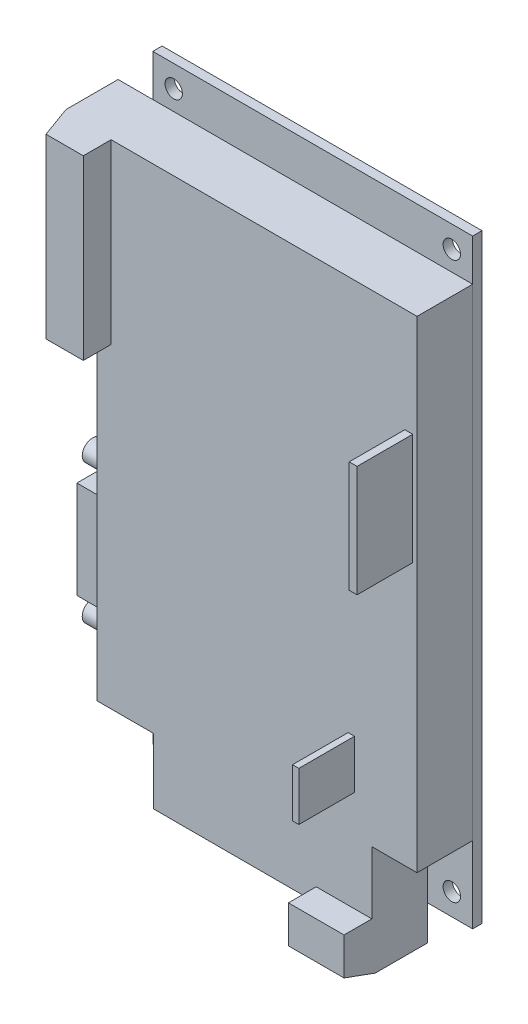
ISO-10303-21;
HEADER;
FILE_DESCRIPTION(('STEP AP214'),'2;1');
FILE_NAME('part.step','',(''),(''),'','','');
FILE_SCHEMA(('AUTOMOTIVE_DESIGN { 1 0 10303 214 1 1 1 1 }'));
ENDSEC;
DATA;
#1=APPLICATION_CONTEXT('core data for automotive mechanical design processes');
#2=APPLICATION_PROTOCOL_DEFINITION('international standard','automotive_design',2000,#1);
#3=PRODUCT_CONTEXT('',#1,'mechanical');
#4=PRODUCT('Part','Part','',(#3));
#5=PRODUCT_RELATED_PRODUCT_CATEGORY('part','',(#4));
#6=PRODUCT_DEFINITION_FORMATION('','',#4);
#7=PRODUCT_DEFINITION_CONTEXT('part definition',#1,'design');
#8=PRODUCT_DEFINITION('design','',#6,#7);
#9=PRODUCT_DEFINITION_SHAPE('','',#8);
#10=(LENGTH_UNIT() NAMED_UNIT(*) SI_UNIT(.MILLI.,.METRE.));
#11=(NAMED_UNIT(*) PLANE_ANGLE_UNIT() SI_UNIT($,.RADIAN.));
#12=(NAMED_UNIT(*) SI_UNIT($,.STERADIAN.) SOLID_ANGLE_UNIT());
#13=UNCERTAINTY_MEASURE_WITH_UNIT(LENGTH_MEASURE(1.E-05),#10,'distance_accuracy_value','');
#14=(GEOMETRIC_REPRESENTATION_CONTEXT(3) GLOBAL_UNCERTAINTY_ASSIGNED_CONTEXT((#13)) GLOBAL_UNIT_ASSIGNED_CONTEXT((#10,
#11,#12)) REPRESENTATION_CONTEXT('',''));
#15=CARTESIAN_POINT('',(0.,0.,0.));
#16=DIRECTION('',(0.,0.,1.));
#17=DIRECTION('',(1.,0.,0.));
#18=AXIS2_PLACEMENT_3D('',#15,#16,#17);
#19=CARTESIAN_POINT('',(1.22991894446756E-12,-109.601,1.70179999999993));
#20=DIRECTION('',(0.,1.,0.));
#21=DIRECTION('',(-1.,0.,0.));
#22=AXIS2_PLACEMENT_3D('',#19,#20,#21);
#23=PLANE('',#22);
#24=DIRECTION('',(1.,0.,0.));
#25=VECTOR('',#24,1.);
#26=CARTESIAN_POINT('',(1.22991894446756E-12,-109.601,1.70179999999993));
#27=LINE('',#26,#25);
#28=CARTESIAN_POINT('',(-48.1329999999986,-109.601,1.70179999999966));
#29=VERTEX_POINT('',#28);
#30=CARTESIAN_POINT('',(-18.4149999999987,-109.601,1.70179999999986));
#31=VERTEX_POINT('',#30);
#32=EDGE_CURVE('E11',#29,#31,#27,.T.);
#33=ORIENTED_EDGE('',*,*,#32,.F.);
#34=DIRECTION('',(1.,0.,0.));
#35=VECTOR('',#34,1.);
#36=CARTESIAN_POINT('',(1.22991894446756E-12,-109.601,1.70179999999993));
#37=LINE('',#36,#35);
#38=CARTESIAN_POINT('',(-58.4199999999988,-109.601,1.70179999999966));
#39=VERTEX_POINT('',#38);
#40=EDGE_CURVE('E653',#39,#29,#37,.T.);
#41=ORIENTED_EDGE('',*,*,#40,.F.);
#42=DIRECTION('',(0.,0.,-1.));
#43=VECTOR('',#42,1.);
#44=CARTESIAN_POINT('',(-58.4199999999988,-109.601,1.70179999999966));
#45=LINE('',#44,#43);
#46=CARTESIAN_POINT('',(-58.4199999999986,-109.600999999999,-3.05311331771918E-13));
#47=VERTEX_POINT('',#46);
#48=EDGE_CURVE('E553',#39,#47,#45,.T.);
#49=ORIENTED_EDGE('',*,*,#48,.T.);
#50=DIRECTION('',(1.,0.,0.));
#51=VECTOR('',#50,1.);
#52=CARTESIAN_POINT('',(1.19002030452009E-12,-109.601,0.));
#53=LINE('',#52,#51);
#54=CARTESIAN_POINT('',(1.19002030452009E-12,-109.601,0.));
#55=VERTEX_POINT('',#54);
#56=EDGE_CURVE('E633',#47,#55,#53,.T.);
#57=ORIENTED_EDGE('',*,*,#56,.T.);
#58=DIRECTION('',(0.,0.,-1.));
#59=VECTOR('',#58,1.);
#60=CARTESIAN_POINT('',(1.22991894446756E-12,-109.601,1.70179999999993));
#61=LINE('',#60,#59);
#62=CARTESIAN_POINT('',(1.22991894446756E-12,-109.601,1.70179999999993));
#63=VERTEX_POINT('',#62);
#64=EDGE_CURVE('E650',#63,#55,#61,.T.);
#65=ORIENTED_EDGE('',*,*,#64,.F.);
#66=CARTESIAN_POINT('',(-8.25499999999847,-109.601,1.70179999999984));
#67=VERTEX_POINT('',#66);
#68=EDGE_CURVE('E584',#67,#63,#37,.T.);
#69=ORIENTED_EDGE('',*,*,#68,.F.);
#70=DIRECTION('',(1.,0.,0.));
#71=VECTOR('',#70,1.);
#72=CARTESIAN_POINT('',(1.22991894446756E-12,-109.601,1.70179999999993));
#73=LINE('',#72,#71);
#74=EDGE_CURVE('E301',#31,#67,#73,.T.);
#75=ORIENTED_EDGE('',*,*,#74,.F.);
#76=EDGE_LOOP('',(#33,#41,#49,#57,#65,#69,#75));
#77=FACE_BOUND('',#76,.T.);
#78=ADVANCED_FACE('F28',(#77),#23,.F.);
#79=CARTESIAN_POINT('',(-58.42,7.49400541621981E-13,1.70179999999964));
#80=DIRECTION('',(1.,0.,0.));
#81=DIRECTION('',(0.,1.,0.));
#82=AXIS2_PLACEMENT_3D('',#79,#80,#81);
#83=PLANE('',#82);
#84=DIRECTION('',(0.,-1.,0.));
#85=VECTOR('',#84,1.);
#86=CARTESIAN_POINT('',(-58.42,7.49400541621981E-13,1.70179999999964));
#87=LINE('',#86,#85);
#88=CARTESIAN_POINT('',(-58.4199999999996,-40.0049999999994,1.7017999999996));
#89=VERTEX_POINT('',#88);
#90=CARTESIAN_POINT('',(-58.4199999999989,-97.6629999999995,1.70179999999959));
#91=VERTEX_POINT('',#90);
#92=EDGE_CURVE('E38',#89,#91,#87,.T.);
#93=ORIENTED_EDGE('',*,*,#92,.F.);
#94=DIRECTION('',(0.,-1.,0.));
#95=VECTOR('',#94,1.);
#96=CARTESIAN_POINT('',(-58.42,7.49400541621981E-13,1.70179999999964));
#97=LINE('',#96,#95);
#98=CARTESIAN_POINT('',(-58.4200000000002,-7.61999999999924,1.70179999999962));
#99=VERTEX_POINT('',#98);
#100=EDGE_CURVE('E336',#99,#89,#97,.T.);
#101=ORIENTED_EDGE('',*,*,#100,.F.);
#102=DIRECTION('',(0.,-1.,0.));
#103=VECTOR('',#102,1.);
#104=CARTESIAN_POINT('',(-58.42,7.49400541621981E-13,1.70179999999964));
#105=LINE('',#104,#103);
#106=CARTESIAN_POINT('',(-58.42,7.49400541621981E-13,1.70179999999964));
#107=VERTEX_POINT('',#106);
#108=EDGE_CURVE('E555',#107,#99,#105,.T.);
#109=ORIENTED_EDGE('',*,*,#108,.F.);
#110=DIRECTION('',(0.,0.,-1.));
#111=VECTOR('',#110,1.);
#112=CARTESIAN_POINT('',(-58.42,7.49400541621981E-13,1.70179999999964));
#113=LINE('',#112,#111);
#114=CARTESIAN_POINT('',(-58.4199999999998,8.60422844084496E-13,-3.67761376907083E-13));
#115=VERTEX_POINT('',#114);
#116=EDGE_CURVE('E647',#107,#115,#113,.T.);
#117=ORIENTED_EDGE('',*,*,#116,.T.);
#118=DIRECTION('',(0.,-1.,0.));
#119=VECTOR('',#118,1.);
#120=CARTESIAN_POINT('',(-58.4199999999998,8.60422844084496E-13,-3.67761376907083E-13));
#121=LINE('',#120,#119);
#122=EDGE_CURVE('E631',#115,#47,#121,.T.);
#123=ORIENTED_EDGE('',*,*,#122,.T.);
#124=ORIENTED_EDGE('',*,*,#48,.F.);
#125=EDGE_CURVE('E543',#91,#39,#105,.T.);
#126=ORIENTED_EDGE('',*,*,#125,.F.);
#127=EDGE_LOOP('',(#93,#101,#109,#117,#123,#124,#126));
#128=FACE_BOUND('',#127,.T.);
#129=ADVANCED_FACE('F551',(#128),#83,.F.);
#130=CARTESIAN_POINT('',(1.71737624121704E-13,0.,1.70180000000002));
#131=DIRECTION('',(-1.,0.,0.));
#132=DIRECTION('',(0.,-1.,0.));
#133=AXIS2_PLACEMENT_3D('',#130,#131,#132);
#134=PLANE('',#133);
#135=DIRECTION('',(0.,1.,0.));
#136=VECTOR('',#135,1.);
#137=CARTESIAN_POINT('',(1.71737624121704E-13,0.,1.70180000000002));
#138=LINE('',#137,#136);
#139=CARTESIAN_POINT('',(1.40165656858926E-12,-95.6310000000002,1.70179999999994));
#140=VERTEX_POINT('',#139);
#141=CARTESIAN_POINT('',(1.72604985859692E-13,-7.61999999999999,1.70180000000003));
#142=VERTEX_POINT('',#141);
#143=EDGE_CURVE('E516',#140,#142,#138,.T.);
#144=ORIENTED_EDGE('',*,*,#143,.F.);
#145=DIRECTION('',(0.,1.,0.));
#146=VECTOR('',#145,1.);
#147=CARTESIAN_POINT('',(1.71737624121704E-13,0.,1.70180000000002));
#148=LINE('',#147,#146);
#149=EDGE_CURVE('E642',#63,#140,#148,.T.);
#150=ORIENTED_EDGE('',*,*,#149,.F.);
#151=ORIENTED_EDGE('',*,*,#64,.T.);
#152=DIRECTION('',(0.,1.,0.));
#153=VECTOR('',#152,1.);
#154=CARTESIAN_POINT('',(1.66533453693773E-13,0.,0.));
#155=LINE('',#154,#153);
#156=CARTESIAN_POINT('',(1.66533453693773E-13,0.,0.));
#157=VERTEX_POINT('',#156);
#158=EDGE_CURVE('E626',#55,#157,#155,.T.);
#159=ORIENTED_EDGE('',*,*,#158,.T.);
#160=DIRECTION('',(0.,0.,-1.));
#161=VECTOR('',#160,1.);
#162=CARTESIAN_POINT('',(1.71737624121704E-13,0.,1.70180000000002));
#163=LINE('',#162,#161);
#164=CARTESIAN_POINT('',(1.71737624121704E-13,0.,1.70180000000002));
#165=VERTEX_POINT('',#164);
#166=EDGE_CURVE('E446',#165,#157,#163,.T.);
#167=ORIENTED_EDGE('',*,*,#166,.F.);
#168=EDGE_CURVE('E635',#142,#165,#148,.T.);
#169=ORIENTED_EDGE('',*,*,#168,.F.);
#170=EDGE_LOOP('',(#144,#150,#151,#159,#167,#169));
#171=FACE_BOUND('',#170,.T.);
#172=ADVANCED_FACE('F671',(#171),#134,.F.);
#173=CARTESIAN_POINT('',(-8.25499999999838,-109.601,11.8617999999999));
#174=DIRECTION('',(0.,0.,1.));
#175=DIRECTION('',(1.,0.,0.));
#176=AXIS2_PLACEMENT_3D('',#173,#174,#175);
#177=PLANE('',#176);
#178=DIRECTION('',(0.,1.,0.));
#179=VECTOR('',#178,1.);
#180=CARTESIAN_POINT('',(-11.4299999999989,-79.7559999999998,11.8617999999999));
#181=LINE('',#180,#179);
#182=CARTESIAN_POINT('',(-11.4299999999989,-88.6460000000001,11.8617999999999));
#183=VERTEX_POINT('',#182);
#184=CARTESIAN_POINT('',(-11.4299999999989,-79.7559999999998,11.8617999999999));
#185=VERTEX_POINT('',#184);
#186=EDGE_CURVE('E372',#183,#185,#181,.T.);
#187=ORIENTED_EDGE('',*,*,#186,.F.);
#188=DIRECTION('',(1.,0.,0.));
#189=VECTOR('',#188,1.);
#190=CARTESIAN_POINT('',(-11.4299999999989,-88.6460000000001,11.8617999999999));
#191=LINE('',#190,#189);
#192=CARTESIAN_POINT('',(-12.5873212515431,-88.6460000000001,11.8617999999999));
#193=VERTEX_POINT('',#192);
#194=EDGE_CURVE('E381',#193,#183,#191,.T.);
#195=ORIENTED_EDGE('',*,*,#194,.F.);
#196=DIRECTION('',(0.,-1.,0.));
#197=VECTOR('',#196,1.);
#198=CARTESIAN_POINT('',(-12.5873212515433,-79.756,11.8617999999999));
#199=LINE('',#198,#197);
#200=CARTESIAN_POINT('',(-12.5873212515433,-79.756,11.8617999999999));
#201=VERTEX_POINT('',#200);
#202=EDGE_CURVE('E378',#201,#193,#199,.T.);
#203=ORIENTED_EDGE('',*,*,#202,.F.);
#204=DIRECTION('',(-1.,0.,0.));
#205=VECTOR('',#204,1.);
#206=CARTESIAN_POINT('',(-11.4299999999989,-79.7559999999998,11.8617999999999));
#207=LINE('',#206,#205);
#208=EDGE_CURVE('E375',#185,#201,#207,.T.);
#209=ORIENTED_EDGE('',*,*,#208,.F.);
#210=EDGE_LOOP('',(#187,#195,#203,#209));
#211=FACE_BOUND('',#210,.T.);
#212=DIRECTION('',(-1.,0.,0.));
#213=VECTOR('',#212,1.);
#214=CARTESIAN_POINT('',(-0.795436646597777,-26.6700000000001,11.8618));
#215=LINE('',#214,#213);
#216=CARTESIAN_POINT('',(-0.795436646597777,-26.6700000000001,11.8618));
#217=VERTEX_POINT('',#216);
#218=CARTESIAN_POINT('',(-2.22882036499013,-26.6699999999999,11.8618));
#219=VERTEX_POINT('',#218);
#220=EDGE_CURVE('E346',#217,#219,#215,.T.);
#221=ORIENTED_EDGE('',*,*,#220,.F.);
#222=DIRECTION('',(0.,1.,0.));
#223=VECTOR('',#222,1.);
#224=CARTESIAN_POINT('',(-0.795436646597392,-46.9900000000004,11.8617999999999));
#225=LINE('',#224,#223);
#226=CARTESIAN_POINT('',(-0.795436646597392,-46.9900000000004,11.8617999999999));
#227=VERTEX_POINT('',#226);
#228=EDGE_CURVE('E343',#227,#217,#225,.T.);
#229=ORIENTED_EDGE('',*,*,#228,.F.);
#230=DIRECTION('',(1.,0.,0.));
#231=VECTOR('',#230,1.);
#232=CARTESIAN_POINT('',(-0.795436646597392,-46.9900000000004,11.8617999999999));
#233=LINE('',#232,#231);
#234=CARTESIAN_POINT('',(-2.22882036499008,-46.9899999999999,11.8618));
#235=VERTEX_POINT('',#234);
#236=EDGE_CURVE('E351',#235,#227,#233,.T.);
#237=ORIENTED_EDGE('',*,*,#236,.F.);
#238=DIRECTION('',(0.,-1.,0.));
#239=VECTOR('',#238,1.);
#240=CARTESIAN_POINT('',(-2.22882036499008,-46.9899999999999,11.8618));
#241=LINE('',#240,#239);
#242=EDGE_CURVE('E348',#219,#235,#241,.T.);
#243=ORIENTED_EDGE('',*,*,#242,.F.);
#244=EDGE_LOOP('',(#221,#229,#237,#243));
#245=FACE_BOUND('',#244,.T.);
#246=DIRECTION('',(1.,0.,0.));
#247=VECTOR('',#246,1.);
#248=CARTESIAN_POINT('',(-48.1329999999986,-109.601,11.8617999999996));
#249=LINE('',#248,#247);
#250=CARTESIAN_POINT('',(-48.1329999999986,-109.601,11.8617999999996));
#251=VERTEX_POINT('',#250);
#252=CARTESIAN_POINT('',(-18.4149999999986,-109.601,11.8617999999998));
#253=VERTEX_POINT('',#252);
#254=EDGE_CURVE('E684',#251,#253,#249,.T.);
#255=ORIENTED_EDGE('',*,*,#254,.T.);
#256=DIRECTION('',(0.,1.,0.));
#257=VECTOR('',#256,1.);
#258=CARTESIAN_POINT('',(-18.4149999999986,-109.601,11.8617999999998));
#259=LINE('',#258,#257);
#260=CARTESIAN_POINT('',(-18.4149999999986,-107.061,11.8617999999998));
#261=VERTEX_POINT('',#260);
#262=EDGE_CURVE('E304',#253,#261,#259,.T.);
#263=ORIENTED_EDGE('',*,*,#262,.T.);
#264=DIRECTION('',(1.,0.,0.));
#265=VECTOR('',#264,1.);
#266=CARTESIAN_POINT('',(-8.25499999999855,-107.061,11.8617999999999));
#267=LINE('',#266,#265);
#268=CARTESIAN_POINT('',(-8.25499999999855,-107.061,11.8617999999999));
#269=VERTEX_POINT('',#268);
#270=EDGE_CURVE('E266',#261,#269,#267,.T.);
#271=ORIENTED_EDGE('',*,*,#270,.T.);
#272=DIRECTION('',(0.,1.,0.));
#273=VECTOR('',#272,1.);
#274=CARTESIAN_POINT('',(-8.25499999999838,-109.601,11.8617999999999));
#275=LINE('',#274,#273);
#276=CARTESIAN_POINT('',(-8.2549999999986,-95.6310000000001,11.8617999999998));
#277=VERTEX_POINT('',#276);
#278=EDGE_CURVE('E274',#269,#277,#275,.T.);
#279=ORIENTED_EDGE('',*,*,#278,.T.);
#280=DIRECTION('',(1.,0.,0.));
#281=VECTOR('',#280,1.);
#282=CARTESIAN_POINT('',(-8.2549999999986,-95.6310000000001,11.8617999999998));
#283=LINE('',#282,#281);
#284=CARTESIAN_POINT('',(1.37953884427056E-12,-95.6310000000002,11.8617999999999));
#285=VERTEX_POINT('',#284);
#286=EDGE_CURVE('E617',#277,#285,#283,.T.);
#287=ORIENTED_EDGE('',*,*,#286,.T.);
#288=DIRECTION('',(0.,1.,0.));
#289=VECTOR('',#288,1.);
#290=CARTESIAN_POINT('',(1.37953884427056E-12,-95.6310000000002,11.8617999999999));
#291=LINE('',#290,#289);
#292=CARTESIAN_POINT('',(2.45897052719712E-13,-7.61999999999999,11.8618000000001));
#293=VERTEX_POINT('',#292);
#294=EDGE_CURVE('E613',#285,#293,#291,.T.);
#295=ORIENTED_EDGE('',*,*,#294,.T.);
#296=DIRECTION('',(-1.,0.,0.));
#297=VECTOR('',#296,1.);
#298=CARTESIAN_POINT('',(-58.4199999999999,-7.61999999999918,11.8617999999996));
#299=LINE('',#298,#297);
#300=CARTESIAN_POINT('',(-55.8799999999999,-7.61999999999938,11.8617999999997));
#301=VERTEX_POINT('',#300);
#302=EDGE_CURVE('E611',#293,#301,#299,.T.);
#303=ORIENTED_EDGE('',*,*,#302,.T.);
#304=DIRECTION('',(0.,1.,0.));
#305=VECTOR('',#304,1.);
#306=CARTESIAN_POINT('',(-55.8799999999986,-109.601,11.8617999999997));
#307=LINE('',#306,#305);
#308=CARTESIAN_POINT('',(-55.8799999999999,-40.0049999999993,11.8617999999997));
#309=VERTEX_POINT('',#308);
#310=EDGE_CURVE('E334',#309,#301,#307,.T.);
#311=ORIENTED_EDGE('',*,*,#310,.F.);
#312=DIRECTION('',(-1.,0.,0.));
#313=VECTOR('',#312,1.);
#314=CARTESIAN_POINT('',(-8.25499999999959,-40.005,11.8617999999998));
#315=LINE('',#314,#313);
#316=CARTESIAN_POINT('',(-58.4199999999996,-40.0049999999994,11.8617999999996));
#317=VERTEX_POINT('',#316);
#318=EDGE_CURVE('E339',#309,#317,#315,.T.);
#319=ORIENTED_EDGE('',*,*,#318,.T.);
#320=DIRECTION('',(0.,-1.,0.));
#321=VECTOR('',#320,1.);
#322=CARTESIAN_POINT('',(-58.4199999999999,-7.61999999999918,11.8617999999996));
#323=LINE('',#322,#321);
#324=CARTESIAN_POINT('',(-58.4199999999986,-97.6629999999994,11.8617999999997));
#325=VERTEX_POINT('',#324);
#326=EDGE_CURVE('E614',#317,#325,#323,.T.);
#327=ORIENTED_EDGE('',*,*,#326,.T.);
#328=DIRECTION('',(1.,0.,0.));
#329=VECTOR('',#328,1.);
#330=CARTESIAN_POINT('',(-48.1329999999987,-97.6629999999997,11.8617999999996));
#331=LINE('',#330,#329);
#332=CARTESIAN_POINT('',(-48.1329999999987,-97.6629999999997,11.8617999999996));
#333=VERTEX_POINT('',#332);
#334=EDGE_CURVE('E559',#325,#333,#331,.T.);
#335=ORIENTED_EDGE('',*,*,#334,.T.);
#336=DIRECTION('',(0.,-1.,0.));
#337=VECTOR('',#336,1.);
#338=CARTESIAN_POINT('',(-48.1329999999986,-109.601,11.8617999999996));
#339=LINE('',#338,#337);
#340=EDGE_CURVE('E622',#333,#251,#339,.T.);
#341=ORIENTED_EDGE('',*,*,#340,.T.);
#342=EDGE_LOOP('',(#255,#263,#271,#279,#287,#295,#303,#311,#319,#327,#335,#341));
#343=FACE_BOUND('',#342,.T.);
#344=ADVANCED_FACE('F610',(#211,#245,#343),#177,.T.);
#345=DIRECTION('',(0.,0.,-1.));
#346=VECTOR('',#345,1.);
#347=CARTESIAN_POINT('',(-48.1329999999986,-109.601,11.8617999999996));
#348=LINE('',#347,#346);
#349=EDGE_CURVE('E563',#251,#29,#348,.T.);
#350=ORIENTED_EDGE('',*,*,#349,.T.);
#351=ORIENTED_EDGE('',*,*,#32,.T.);
#352=DIRECTION('',(0.,0.,-1.));
#353=VECTOR('',#352,1.);
#354=CARTESIAN_POINT('',(-18.4149999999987,-109.601,1.70179999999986));
#355=LINE('',#354,#353);
#356=EDGE_CURVE('E498',#253,#31,#355,.T.);
#357=ORIENTED_EDGE('',*,*,#356,.F.);
#358=ORIENTED_EDGE('',*,*,#254,.F.);
#359=EDGE_LOOP('',(#350,#351,#357,#358));
#360=FACE_BOUND('',#359,.T.);
#361=ADVANCED_FACE('F701',(#360),#23,.F.);
#362=DIRECTION('',(0.,1.,0.));
#363=VECTOR('',#362,1.);
#364=CARTESIAN_POINT('',(-58.419999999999,-85.4709999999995,9.22312221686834));
#365=LINE('',#364,#363);
#366=CARTESIAN_POINT('',(-58.419999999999,-85.4709999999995,9.22312221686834));
#367=VERTEX_POINT('',#366);
#368=CARTESIAN_POINT('',(-58.4199999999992,-67.6909999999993,9.22312221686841));
#369=VERTEX_POINT('',#368);
#370=EDGE_CURVE('E405',#367,#369,#365,.T.);
#371=ORIENTED_EDGE('',*,*,#370,.F.);
#372=DIRECTION('',(0.,0.,1.));
#373=VECTOR('',#372,1.);
#374=CARTESIAN_POINT('',(-58.419999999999,-85.4709999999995,9.22312221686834));
#375=LINE('',#374,#373);
#376=CARTESIAN_POINT('',(-58.419999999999,-85.4709999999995,3.47687778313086));
#377=VERTEX_POINT('',#376);
#378=EDGE_CURVE('E414',#377,#367,#375,.T.);
#379=ORIENTED_EDGE('',*,*,#378,.F.);
#380=DIRECTION('',(0.,-1.,0.));
#381=VECTOR('',#380,1.);
#382=CARTESIAN_POINT('',(-58.419999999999,-85.4709999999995,3.47687778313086));
#383=LINE('',#382,#381);
#384=CARTESIAN_POINT('',(-58.4199999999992,-67.6909999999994,3.47687778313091));
#385=VERTEX_POINT('',#384);
#386=EDGE_CURVE('E411',#385,#377,#383,.T.);
#387=ORIENTED_EDGE('',*,*,#386,.F.);
#388=DIRECTION('',(0.,0.,-1.));
#389=VECTOR('',#388,1.);
#390=CARTESIAN_POINT('',(-58.4199999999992,-67.6909999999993,9.22312221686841));
#391=LINE('',#390,#389);
#392=EDGE_CURVE('E408',#369,#385,#391,.T.);
#393=ORIENTED_EDGE('',*,*,#392,.F.);
#394=EDGE_LOOP('',(#371,#379,#387,#393));
#395=FACE_BOUND('',#394,.T.);
#396=CARTESIAN_POINT('',(-58.4199999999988,-89.2809999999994,6.34999999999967));
#397=DIRECTION('',(-1.,0.,0.));
#398=DIRECTION('',(0.,-1.,0.));
#399=AXIS2_PLACEMENT_3D('',#396,#397,#398);
#400=CIRCLE('',#399,1.8971432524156);
#401=CARTESIAN_POINT('',(-58.4199999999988,-87.3838567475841,6.34999999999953));
#402=VERTEX_POINT('',#401);
#403=EDGE_CURVE('E442',#402,#402,#400,.T.);
#404=ORIENTED_EDGE('',*,*,#403,.F.);
#405=EDGE_LOOP('',(#404));
#406=FACE_BOUND('',#405,.T.);
#407=CARTESIAN_POINT('',(-58.419999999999,-63.8809999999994,6.34999999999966));
#408=DIRECTION('',(1.,0.,0.));
#409=DIRECTION('',(0.,1.,0.));
#410=AXIS2_PLACEMENT_3D('',#407,#408,#409);
#411=CIRCLE('',#410,1.8971432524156);
#412=CARTESIAN_POINT('',(-58.419999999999,-61.983856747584,6.34999999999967));
#413=VERTEX_POINT('',#412);
#414=EDGE_CURVE('E445',#413,#413,#411,.F.);
#415=ORIENTED_EDGE('',*,*,#414,.F.);
#416=EDGE_LOOP('',(#415));
#417=FACE_BOUND('',#416,.T.);
#418=DIRECTION('',(0.,0.,1.));
#419=VECTOR('',#418,1.);
#420=CARTESIAN_POINT('',(-58.4199999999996,-40.0049999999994,1.7017999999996));
#421=LINE('',#420,#419);
#422=EDGE_CURVE('E495',#89,#317,#421,.T.);
#423=ORIENTED_EDGE('',*,*,#422,.F.);
#424=ORIENTED_EDGE('',*,*,#92,.T.);
#425=DIRECTION('',(0.,0.,-1.));
#426=VECTOR('',#425,1.);
#427=CARTESIAN_POINT('',(-58.4199999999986,-97.6629999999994,11.8617999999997));
#428=LINE('',#427,#426);
#429=EDGE_CURVE('E533',#325,#91,#428,.T.);
#430=ORIENTED_EDGE('',*,*,#429,.F.);
#431=ORIENTED_EDGE('',*,*,#326,.F.);
#432=EDGE_LOOP('',(#423,#424,#430,#431));
#433=FACE_BOUND('',#432,.T.);
#434=ADVANCED_FACE('F530',(#395,#406,#417,#433),#83,.F.);
#435=CARTESIAN_POINT('',(1.71737624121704E-13,0.,1.70180000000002));
#436=DIRECTION('',(0.,0.,-1.));
#437=DIRECTION('',(-1.,0.,0.));
#438=AXIS2_PLACEMENT_3D('',#435,#436,#437);
#439=PLANE('',#438);
#440=CARTESIAN_POINT('',(-54.6099999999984,-105.6005,1.70179999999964));
#441=DIRECTION('',(0.,0.,1.));
#442=DIRECTION('',(1.,0.,0.));
#443=AXIS2_PLACEMENT_3D('',#440,#441,#442);
#444=CIRCLE('',#443,1.5875);
#445=CARTESIAN_POINT('',(-53.0224999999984,-105.6005,1.70179999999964));
#446=VERTEX_POINT('',#445);
#447=EDGE_CURVE('E467',#446,#446,#444,.T.);
#448=ORIENTED_EDGE('',*,*,#447,.F.);
#449=EDGE_LOOP('',(#448));
#450=FACE_BOUND('',#449,.T.);
#451=DIRECTION('',(0.,-1.,0.));
#452=VECTOR('',#451,1.);
#453=CARTESIAN_POINT('',(-48.1329999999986,-109.601,1.70179999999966));
#454=LINE('',#453,#452);
#455=CARTESIAN_POINT('',(-48.1329999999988,-97.6629999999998,1.70179999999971));
#456=VERTEX_POINT('',#455);
#457=EDGE_CURVE('E546',#456,#29,#454,.T.);
#458=ORIENTED_EDGE('',*,*,#457,.F.);
#459=DIRECTION('',(1.,0.,0.));
#460=VECTOR('',#459,1.);
#461=CARTESIAN_POINT('',(-48.1329999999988,-97.6629999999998,1.70179999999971));
#462=LINE('',#461,#460);
#463=EDGE_CURVE('E540',#91,#456,#462,.T.);
#464=ORIENTED_EDGE('',*,*,#463,.F.);
#465=ORIENTED_EDGE('',*,*,#125,.T.);
#466=ORIENTED_EDGE('',*,*,#40,.T.);
#467=EDGE_LOOP('',(#458,#464,#465,#466));
#468=FACE_BOUND('',#467,.T.);
#469=ADVANCED_FACE('F541',(#450,#468),#439,.F.);
#470=CARTESIAN_POINT('',(-54.6099999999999,-4.0004999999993,1.70179999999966));
#471=DIRECTION('',(0.,0.,1.));
#472=DIRECTION('',(1.,0.,0.));
#473=AXIS2_PLACEMENT_3D('',#470,#471,#472);
#474=CIRCLE('',#473,1.5875);
#475=CARTESIAN_POINT('',(-53.0224999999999,-4.00049999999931,1.70179999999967));
#476=VERTEX_POINT('',#475);
#477=EDGE_CURVE('E449',#476,#476,#474,.T.);
#478=ORIENTED_EDGE('',*,*,#477,.F.);
#479=EDGE_LOOP('',(#478));
#480=FACE_BOUND('',#479,.T.);
#481=CARTESIAN_POINT('',(-3.80999999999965,-4.00049999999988,1.70179999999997));
#482=DIRECTION('',(0.,0.,1.));
#483=DIRECTION('',(1.,0.,0.));
#484=AXIS2_PLACEMENT_3D('',#481,#482,#483);
#485=CIRCLE('',#484,1.5875);
#486=CARTESIAN_POINT('',(-2.22249999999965,-4.0004999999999,1.70179999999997));
#487=VERTEX_POINT('',#486);
#488=EDGE_CURVE('E455',#487,#487,#485,.T.);
#489=ORIENTED_EDGE('',*,*,#488,.F.);
#490=EDGE_LOOP('',(#489));
#491=FACE_BOUND('',#490,.T.);
#492=DIRECTION('',(-1.,0.,0.));
#493=VECTOR('',#492,1.);
#494=CARTESIAN_POINT('',(-58.4200000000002,-7.61999999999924,1.70179999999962));
#495=LINE('',#494,#493);
#496=EDGE_CURVE('E483',#142,#99,#495,.T.);
#497=ORIENTED_EDGE('',*,*,#496,.F.);
#498=ORIENTED_EDGE('',*,*,#168,.T.);
#499=DIRECTION('',(-1.,0.,0.));
#500=VECTOR('',#499,1.);
#501=CARTESIAN_POINT('',(1.71737624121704E-13,0.,1.70180000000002));
#502=LINE('',#501,#500);
#503=EDGE_CURVE('E556',#165,#107,#502,.T.);
#504=ORIENTED_EDGE('',*,*,#503,.T.);
#505=ORIENTED_EDGE('',*,*,#108,.T.);
#506=EDGE_LOOP('',(#497,#498,#504,#505));
#507=FACE_BOUND('',#506,.T.);
#508=ADVANCED_FACE('F580',(#480,#491,#507),#439,.F.);
#509=CARTESIAN_POINT('',(-3.80999999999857,-105.6005,1.70179999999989));
#510=DIRECTION('',(0.,0.,1.));
#511=DIRECTION('',(1.,0.,0.));
#512=AXIS2_PLACEMENT_3D('',#509,#510,#511);
#513=CIRCLE('',#512,1.5875);
#514=CARTESIAN_POINT('',(-2.22249999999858,-105.6005,1.70179999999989));
#515=VERTEX_POINT('',#514);
#516=EDGE_CURVE('E461',#515,#515,#513,.T.);
#517=ORIENTED_EDGE('',*,*,#516,.F.);
#518=EDGE_LOOP('',(#517));
#519=FACE_BOUND('',#518,.T.);
#520=DIRECTION('',(1.,0.,0.));
#521=VECTOR('',#520,1.);
#522=CARTESIAN_POINT('',(-8.25499999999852,-95.631,1.70179999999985));
#523=LINE('',#522,#521);
#524=CARTESIAN_POINT('',(-8.25499999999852,-95.631,1.70179999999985));
#525=VERTEX_POINT('',#524);
#526=EDGE_CURVE('E479',#525,#140,#523,.T.);
#527=ORIENTED_EDGE('',*,*,#526,.F.);
#528=DIRECTION('',(0.,1.,0.));
#529=VECTOR('',#528,1.);
#530=CARTESIAN_POINT('',(-8.25499999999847,-109.601,1.70179999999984));
#531=LINE('',#530,#529);
#532=EDGE_CURVE('E473',#67,#525,#531,.T.);
#533=ORIENTED_EDGE('',*,*,#532,.F.);
#534=ORIENTED_EDGE('',*,*,#68,.T.);
#535=ORIENTED_EDGE('',*,*,#149,.T.);
#536=EDGE_LOOP('',(#527,#533,#534,#535));
#537=FACE_BOUND('',#536,.T.);
#538=ADVANCED_FACE('F664',(#519,#537),#439,.F.);
#539=DIRECTION('',(0.,0.,-1.));
#540=VECTOR('',#539,1.);
#541=CARTESIAN_POINT('',(1.37953884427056E-12,-95.6310000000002,11.8617999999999));
#542=LINE('',#541,#540);
#543=EDGE_CURVE('E486',#285,#140,#542,.T.);
#544=ORIENTED_EDGE('',*,*,#543,.T.);
#545=ORIENTED_EDGE('',*,*,#143,.T.);
#546=DIRECTION('',(0.,0.,-1.));
#547=VECTOR('',#546,1.);
#548=CARTESIAN_POINT('',(2.45897052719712E-13,-7.61999999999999,11.8618000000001));
#549=LINE('',#548,#547);
#550=EDGE_CURVE('E490',#293,#142,#549,.T.);
#551=ORIENTED_EDGE('',*,*,#550,.F.);
#552=ORIENTED_EDGE('',*,*,#294,.F.);
#553=EDGE_LOOP('',(#544,#545,#551,#552));
#554=FACE_BOUND('',#553,.T.);
#555=ADVANCED_FACE('F30',(#554),#134,.F.);
#556=CARTESIAN_POINT('',(1.71737624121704E-13,0.,1.70180000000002));
#557=DIRECTION('',(0.,-1.,0.));
#558=DIRECTION('',(1.,0.,0.));
#559=AXIS2_PLACEMENT_3D('',#556,#557,#558);
#560=PLANE('',#559);
#561=DIRECTION('',(-1.,0.,0.));
#562=VECTOR('',#561,1.);
#563=CARTESIAN_POINT('',(1.66533453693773E-13,0.,0.));
#564=LINE('',#563,#562);
#565=EDGE_CURVE('E629',#157,#115,#564,.T.);
#566=ORIENTED_EDGE('',*,*,#565,.T.);
#567=ORIENTED_EDGE('',*,*,#116,.F.);
#568=ORIENTED_EDGE('',*,*,#503,.F.);
#569=ORIENTED_EDGE('',*,*,#166,.T.);
#570=EDGE_LOOP('',(#566,#567,#568,#569));
#571=FACE_BOUND('',#570,.T.);
#572=ADVANCED_FACE('F1045',(#571),#560,.F.);
#573=CARTESIAN_POINT('',(1.66533453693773E-13,0.,0.));
#574=DIRECTION('',(0.,0.,-1.));
#575=DIRECTION('',(-1.,0.,0.));
#576=AXIS2_PLACEMENT_3D('',#573,#574,#575);
#577=PLANE('',#576);
#578=CARTESIAN_POINT('',(-54.6099999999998,-4.00049999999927,-3.50414142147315E-13));
#579=DIRECTION('',(0.,0.,1.));
#580=DIRECTION('',(1.,0.,0.));
#581=AXIS2_PLACEMENT_3D('',#578,#579,#580);
#582=CIRCLE('',#581,1.5875);
#583=CARTESIAN_POINT('',(-53.0224999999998,-4.00049999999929,-3.41755169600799E-13));
#584=VERTEX_POINT('',#583);
#585=EDGE_CURVE('E452',#584,#584,#582,.T.);
#586=ORIENTED_EDGE('',*,*,#585,.T.);
#587=EDGE_LOOP('',(#586));
#588=FACE_BOUND('',#587,.T.);
#589=CARTESIAN_POINT('',(-3.80999999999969,-4.00049999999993,0.));
#590=DIRECTION('',(0.,0.,1.));
#591=DIRECTION('',(1.,0.,0.));
#592=AXIS2_PLACEMENT_3D('',#589,#590,#591);
#593=CIRCLE('',#592,1.5875);
#594=CARTESIAN_POINT('',(-2.2224999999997,-4.00049999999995,0.));
#595=VERTEX_POINT('',#594);
#596=EDGE_CURVE('E458',#595,#595,#593,.T.);
#597=ORIENTED_EDGE('',*,*,#596,.T.);
#598=EDGE_LOOP('',(#597));
#599=FACE_BOUND('',#598,.T.);
#600=CARTESIAN_POINT('',(-3.80999999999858,-105.6005,-1.04083408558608E-13));
#601=DIRECTION('',(0.,0.,1.));
#602=DIRECTION('',(1.,0.,0.));
#603=AXIS2_PLACEMENT_3D('',#600,#601,#602);
#604=CIRCLE('',#603,1.5875);
#605=CARTESIAN_POINT('',(-2.22249999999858,-105.6005,0.));
#606=VERTEX_POINT('',#605);
#607=EDGE_CURVE('E464',#606,#606,#604,.T.);
#608=ORIENTED_EDGE('',*,*,#607,.T.);
#609=EDGE_LOOP('',(#608));
#610=FACE_BOUND('',#609,.T.);
#611=CARTESIAN_POINT('',(-54.6099999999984,-105.6005,-3.19189119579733E-13));
#612=DIRECTION('',(0.,0.,1.));
#613=DIRECTION('',(1.,0.,0.));
#614=AXIS2_PLACEMENT_3D('',#611,#612,#613);
#615=CIRCLE('',#614,1.5875);
#616=CARTESIAN_POINT('',(-53.0224999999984,-105.6005,-3.10530147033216E-13));
#617=VERTEX_POINT('',#616);
#618=EDGE_CURVE('E470',#617,#617,#615,.T.);
#619=ORIENTED_EDGE('',*,*,#618,.T.);
#620=EDGE_LOOP('',(#619));
#621=FACE_BOUND('',#620,.T.);
#622=ORIENTED_EDGE('',*,*,#158,.F.);
#623=ORIENTED_EDGE('',*,*,#56,.F.);
#624=ORIENTED_EDGE('',*,*,#122,.F.);
#625=ORIENTED_EDGE('',*,*,#565,.F.);
#626=EDGE_LOOP('',(#622,#623,#624,#625));
#627=FACE_BOUND('',#626,.T.);
#628=ADVANCED_FACE('F1018',(#588,#599,#610,#621,#627),#577,.T.);
#629=CARTESIAN_POINT('',(-8.25499999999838,-109.601,11.8617999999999));
#630=DIRECTION('',(-1.,0.,0.));
#631=DIRECTION('',(0.,0.,1.));
#632=AXIS2_PLACEMENT_3D('',#629,#630,#631);
#633=PLANE('',#632);
#634=DIRECTION('',(0.,1.,0.));
#635=VECTOR('',#634,1.);
#636=CARTESIAN_POINT('',(-8.25499999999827,-115.951,16.9417999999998));
#637=LINE('',#636,#635);
#638=CARTESIAN_POINT('',(-8.2549999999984,-113.870910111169,16.9417999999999));
#639=VERTEX_POINT('',#638);
#640=CARTESIAN_POINT('',(-8.25499999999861,-107.061,16.9417999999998));
#641=VERTEX_POINT('',#640);
#642=EDGE_CURVE('E256',#639,#641,#637,.T.);
#643=ORIENTED_EDGE('',*,*,#642,.F.);
#644=DIRECTION('',(0.,-0.342020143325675,-0.939692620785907));
#645=VECTOR('',#644,1.);
#646=CARTESIAN_POINT('',(-8.25499999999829,-115.951,11.2267999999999));
#647=LINE('',#646,#645);
#648=CARTESIAN_POINT('',(-8.25499999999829,-115.951,11.2267999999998));
#649=VERTEX_POINT('',#648);
#650=EDGE_CURVE('E507',#639,#649,#647,.T.);
#651=ORIENTED_EDGE('',*,*,#650,.T.);
#652=DIRECTION('',(0.,0.,1.));
#653=VECTOR('',#652,1.);
#654=CARTESIAN_POINT('',(-8.25499999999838,-115.951,1.70179999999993));
#655=LINE('',#654,#653);
#656=CARTESIAN_POINT('',(-8.25499999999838,-115.951,1.70179999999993));
#657=VERTEX_POINT('',#656);
#658=EDGE_CURVE('E283',#657,#649,#655,.T.);
#659=ORIENTED_EDGE('',*,*,#658,.F.);
#660=DIRECTION('',(0.,1.,0.));
#661=VECTOR('',#660,1.);
#662=CARTESIAN_POINT('',(-8.25499999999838,-115.951,1.70179999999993));
#663=LINE('',#662,#661);
#664=EDGE_CURVE('E292',#657,#67,#663,.T.);
#665=ORIENTED_EDGE('',*,*,#664,.T.);
#666=ORIENTED_EDGE('',*,*,#532,.T.);
#667=DIRECTION('',(0.,0.,-1.));
#668=VECTOR('',#667,1.);
#669=CARTESIAN_POINT('',(-8.2549999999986,-95.6310000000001,11.8617999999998));
#670=LINE('',#669,#668);
#671=EDGE_CURVE('E489',#277,#525,#670,.T.);
#672=ORIENTED_EDGE('',*,*,#671,.F.);
#673=ORIENTED_EDGE('',*,*,#278,.F.);
#674=DIRECTION('',(0.,0.,1.));
#675=VECTOR('',#674,1.);
#676=CARTESIAN_POINT('',(-8.25499999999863,-107.061,1.70179999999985));
#677=LINE('',#676,#675);
#678=EDGE_CURVE('E271',#269,#641,#677,.T.);
#679=ORIENTED_EDGE('',*,*,#678,.T.);
#680=EDGE_LOOP('',(#643,#651,#659,#665,#666,#672,#673,#679));
#681=FACE_BOUND('',#680,.T.);
#682=ADVANCED_FACE('F272',(#681),#633,.F.);
#683=CARTESIAN_POINT('',(-8.2549999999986,-95.6310000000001,11.8617999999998));
#684=DIRECTION('',(0.,1.,0.));
#685=DIRECTION('',(0.,0.,1.));
#686=AXIS2_PLACEMENT_3D('',#683,#684,#685);
#687=PLANE('',#686);
#688=ORIENTED_EDGE('',*,*,#526,.T.);
#689=ORIENTED_EDGE('',*,*,#543,.F.);
#690=ORIENTED_EDGE('',*,*,#286,.F.);
#691=ORIENTED_EDGE('',*,*,#671,.T.);
#692=EDGE_LOOP('',(#688,#689,#690,#691));
#693=FACE_BOUND('',#692,.T.);
#694=ADVANCED_FACE('F677',(#693),#687,.F.);
#695=CARTESIAN_POINT('',(-58.4199999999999,-7.61999999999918,11.8617999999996));
#696=DIRECTION('',(0.,-1.,0.));
#697=DIRECTION('',(1.,0.,0.));
#698=AXIS2_PLACEMENT_3D('',#695,#696,#697);
#699=PLANE('',#698);
#700=DIRECTION('',(0.,0.,-1.));
#701=VECTOR('',#700,1.);
#702=CARTESIAN_POINT('',(-64.7699999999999,-7.61999999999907,1.70179999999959));
#703=LINE('',#702,#701);
#704=CARTESIAN_POINT('',(-64.7699999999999,-7.61999999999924,11.2267999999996));
#705=VERTEX_POINT('',#704);
#706=CARTESIAN_POINT('',(-64.7699999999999,-7.61999999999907,1.70179999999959));
#707=VERTEX_POINT('',#706);
#708=EDGE_CURVE('E323',#705,#707,#703,.T.);
#709=ORIENTED_EDGE('',*,*,#708,.F.);
#710=DIRECTION('',(-0.342020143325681,0.,-0.939692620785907));
#711=VECTOR('',#710,1.);
#712=CARTESIAN_POINT('',(-64.7699999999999,-7.61999999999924,11.2267999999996));
#713=LINE('',#712,#711);
#714=CARTESIAN_POINT('',(-62.6899101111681,-7.61999999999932,16.9417999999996));
#715=VERTEX_POINT('',#714);
#716=EDGE_CURVE('E53',#705,#715,#713,.F.);
#717=ORIENTED_EDGE('',*,*,#716,.T.);
#718=DIRECTION('',(1.,0.,0.));
#719=VECTOR('',#718,1.);
#720=CARTESIAN_POINT('',(-64.7699999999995,-7.61999999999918,16.9417999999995));
#721=LINE('',#720,#719);
#722=CARTESIAN_POINT('',(-55.88,-7.61999999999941,16.9417999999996));
#723=VERTEX_POINT('',#722);
#724=EDGE_CURVE('E328',#715,#723,#721,.T.);
#725=ORIENTED_EDGE('',*,*,#724,.T.);
#726=DIRECTION('',(0.,0.,-1.));
#727=VECTOR('',#726,1.);
#728=CARTESIAN_POINT('',(-55.8800000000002,-7.61999999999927,1.70179999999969));
#729=LINE('',#728,#727);
#730=EDGE_CURVE('E314',#723,#301,#729,.T.);
#731=ORIENTED_EDGE('',*,*,#730,.T.);
#732=ORIENTED_EDGE('',*,*,#302,.F.);
#733=ORIENTED_EDGE('',*,*,#550,.T.);
#734=ORIENTED_EDGE('',*,*,#496,.T.);
#735=DIRECTION('',(1.,0.,0.));
#736=VECTOR('',#735,1.);
#737=CARTESIAN_POINT('',(-64.7699999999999,-7.61999999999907,1.70179999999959));
#738=LINE('',#737,#736);
#739=EDGE_CURVE('E325',#707,#99,#738,.T.);
#740=ORIENTED_EDGE('',*,*,#739,.F.);
#741=EDGE_LOOP('',(#709,#717,#725,#731,#732,#733,#734,#740));
#742=FACE_BOUND('',#741,.T.);
#743=ADVANCED_FACE('F573',(#742),#699,.F.);
#744=CARTESIAN_POINT('',(-48.1329999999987,-97.6629999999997,11.8617999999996));
#745=DIRECTION('',(0.,1.,0.));
#746=DIRECTION('',(0.,0.,1.));
#747=AXIS2_PLACEMENT_3D('',#744,#745,#746);
#748=PLANE('',#747);
#749=ORIENTED_EDGE('',*,*,#463,.T.);
#750=DIRECTION('',(0.,0.,-1.));
#751=VECTOR('',#750,1.);
#752=CARTESIAN_POINT('',(-48.1329999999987,-97.6629999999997,11.8617999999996));
#753=LINE('',#752,#751);
#754=EDGE_CURVE('E560',#333,#456,#753,.T.);
#755=ORIENTED_EDGE('',*,*,#754,.F.);
#756=ORIENTED_EDGE('',*,*,#334,.F.);
#757=ORIENTED_EDGE('',*,*,#429,.T.);
#758=EDGE_LOOP('',(#749,#755,#756,#757));
#759=FACE_BOUND('',#758,.T.);
#760=ADVANCED_FACE('F558',(#759),#748,.F.);
#761=CARTESIAN_POINT('',(-48.1329999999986,-109.601,11.8617999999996));
#762=DIRECTION('',(1.,0.,0.));
#763=DIRECTION('',(0.,0.,-1.));
#764=AXIS2_PLACEMENT_3D('',#761,#762,#763);
#765=PLANE('',#764);
#766=ORIENTED_EDGE('',*,*,#457,.T.);
#767=ORIENTED_EDGE('',*,*,#349,.F.);
#768=ORIENTED_EDGE('',*,*,#340,.F.);
#769=ORIENTED_EDGE('',*,*,#754,.T.);
#770=EDGE_LOOP('',(#766,#767,#768,#769));
#771=FACE_BOUND('',#770,.T.);
#772=ADVANCED_FACE('F705',(#771),#765,.F.);
#773=CARTESIAN_POINT('',(-54.6099999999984,-105.6005,-3.19189119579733E-13));
#774=DIRECTION('',(0.,0.,1.));
#775=DIRECTION('',(1.,0.,0.));
#776=AXIS2_PLACEMENT_3D('',#773,#774,#775);
#777=CYLINDRICAL_SURFACE('',#776,1.5875);
#778=ORIENTED_EDGE('',*,*,#618,.F.);
#779=EDGE_LOOP('',(#778));
#780=FACE_BOUND('',#779,.T.);
#781=ORIENTED_EDGE('',*,*,#447,.T.);
#782=EDGE_LOOP('',(#781));
#783=FACE_BOUND('',#782,.T.);
#784=ADVANCED_FACE('F707',(#780,#783),#777,.F.);
#785=CARTESIAN_POINT('',(-3.80999999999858,-105.6005,-1.04083408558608E-13));
#786=DIRECTION('',(0.,0.,1.));
#787=DIRECTION('',(1.,0.,0.));
#788=AXIS2_PLACEMENT_3D('',#785,#786,#787);
#789=CYLINDRICAL_SURFACE('',#788,1.5875);
#790=ORIENTED_EDGE('',*,*,#607,.F.);
#791=EDGE_LOOP('',(#790));
#792=FACE_BOUND('',#791,.T.);
#793=ORIENTED_EDGE('',*,*,#516,.T.);
#794=EDGE_LOOP('',(#793));
#795=FACE_BOUND('',#794,.T.);
#796=ADVANCED_FACE('F713',(#792,#795),#789,.F.);
#797=CARTESIAN_POINT('',(-3.80999999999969,-4.00049999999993,0.));
#798=DIRECTION('',(0.,0.,1.));
#799=DIRECTION('',(1.,0.,0.));
#800=AXIS2_PLACEMENT_3D('',#797,#798,#799);
#801=CYLINDRICAL_SURFACE('',#800,1.5875);
#802=ORIENTED_EDGE('',*,*,#596,.F.);
#803=EDGE_LOOP('',(#802));
#804=FACE_BOUND('',#803,.T.);
#805=ORIENTED_EDGE('',*,*,#488,.T.);
#806=EDGE_LOOP('',(#805));
#807=FACE_BOUND('',#806,.T.);
#808=ADVANCED_FACE('F739',(#804,#807),#801,.F.);
#809=CARTESIAN_POINT('',(-54.6099999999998,-4.00049999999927,-3.50414142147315E-13));
#810=DIRECTION('',(0.,0.,1.));
#811=DIRECTION('',(1.,0.,0.));
#812=AXIS2_PLACEMENT_3D('',#809,#810,#811);
#813=CYLINDRICAL_SURFACE('',#812,1.5875);
#814=ORIENTED_EDGE('',*,*,#585,.F.);
#815=EDGE_LOOP('',(#814));
#816=FACE_BOUND('',#815,.T.);
#817=ORIENTED_EDGE('',*,*,#477,.T.);
#818=EDGE_LOOP('',(#817));
#819=FACE_BOUND('',#818,.T.);
#820=ADVANCED_FACE('F743',(#816,#819),#813,.F.);
#821=CARTESIAN_POINT('',(-64.7699999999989,-89.2809999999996,6.34999999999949));
#822=DIRECTION('',(1.,0.,0.));
#823=DIRECTION('',(0.,1.,0.));
#824=AXIS2_PLACEMENT_3D('',#821,#822,#823);
#825=CYLINDRICAL_SURFACE('',#824,1.8971432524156);
#826=CARTESIAN_POINT('',(-64.7699999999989,-89.2809999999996,6.34999999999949));
#827=DIRECTION('',(-1.,0.,0.));
#828=DIRECTION('',(0.,-1.,0.));
#829=AXIS2_PLACEMENT_3D('',#826,#827,#828);
#830=CIRCLE('',#829,1.8971432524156);
#831=CARTESIAN_POINT('',(-64.7699999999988,-87.383856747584,6.34999999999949));
#832=VERTEX_POINT('',#831);
#833=EDGE_CURVE('E441',#832,#832,#830,.T.);
#834=CARTESIAN_POINT('',(-64.7699999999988,-87.383856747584,6.34999999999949));
#835=CARTESIAN_POINT('',(-64.7038541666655,-87.383856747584,6.34999999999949));
#836=CARTESIAN_POINT('',(-64.6377083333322,-87.383856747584,6.34999999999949));
#837=CARTESIAN_POINT('',(-64.5054166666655,-87.383856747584,6.34999999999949));
#838=CARTESIAN_POINT('',(-64.4392708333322,-87.383856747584,6.34999999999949));
#839=CARTESIAN_POINT('',(-64.3069791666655,-87.383856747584,6.3499999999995));
#840=CARTESIAN_POINT('',(-64.2408333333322,-87.383856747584,6.3499999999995));
#841=CARTESIAN_POINT('',(-64.1085416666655,-87.383856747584,6.3499999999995));
#842=CARTESIAN_POINT('',(-64.0423958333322,-87.383856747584,6.3499999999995));
#843=CARTESIAN_POINT('',(-63.9101041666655,-87.383856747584,6.3499999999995));
#844=CARTESIAN_POINT('',(-63.8439583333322,-87.383856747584,6.3499999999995));
#845=CARTESIAN_POINT('',(-63.7116666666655,-87.383856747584,6.3499999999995));
#846=CARTESIAN_POINT('',(-63.6455208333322,-87.383856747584,6.3499999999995));
#847=CARTESIAN_POINT('',(-63.5132291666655,-87.383856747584,6.3499999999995));
#848=CARTESIAN_POINT('',(-63.4470833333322,-87.383856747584,6.3499999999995));
#849=CARTESIAN_POINT('',(-63.3147916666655,-87.383856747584,6.3499999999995));
#850=CARTESIAN_POINT('',(-63.2486458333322,-87.383856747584,6.3499999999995));
#851=CARTESIAN_POINT('',(-63.1163541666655,-87.383856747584,6.3499999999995));
#852=CARTESIAN_POINT('',(-63.0502083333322,-87.383856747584,6.3499999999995));
#853=CARTESIAN_POINT('',(-62.9179166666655,-87.383856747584,6.3499999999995));
#854=CARTESIAN_POINT('',(-62.8517708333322,-87.383856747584,6.3499999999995));
#855=CARTESIAN_POINT('',(-62.7194791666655,-87.383856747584,6.3499999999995));
#856=CARTESIAN_POINT('',(-62.6533333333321,-87.383856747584,6.3499999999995));
#857=CARTESIAN_POINT('',(-62.5210416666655,-87.383856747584,6.3499999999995));
#858=CARTESIAN_POINT('',(-62.4548958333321,-87.383856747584,6.3499999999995));
#859=CARTESIAN_POINT('',(-62.3226041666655,-87.383856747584,6.3499999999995));
#860=CARTESIAN_POINT('',(-62.2564583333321,-87.383856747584,6.34999999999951));
#861=CARTESIAN_POINT('',(-62.1241666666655,-87.383856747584,6.34999999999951));
#862=CARTESIAN_POINT('',(-62.0580208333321,-87.383856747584,6.34999999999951));
#863=CARTESIAN_POINT('',(-61.9257291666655,-87.383856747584,6.34999999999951));
#864=CARTESIAN_POINT('',(-61.8595833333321,-87.383856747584,6.34999999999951));
#865=CARTESIAN_POINT('',(-61.7272916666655,-87.383856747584,6.34999999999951));
#866=CARTESIAN_POINT('',(-61.6611458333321,-87.383856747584,6.34999999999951));
#867=CARTESIAN_POINT('',(-61.5288541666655,-87.383856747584,6.34999999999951));
#868=CARTESIAN_POINT('',(-61.4627083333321,-87.383856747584,6.34999999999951));
#869=CARTESIAN_POINT('',(-61.3304166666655,-87.383856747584,6.34999999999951));
#870=CARTESIAN_POINT('',(-61.2642708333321,-87.383856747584,6.34999999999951));
#871=CARTESIAN_POINT('',(-61.1319791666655,-87.383856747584,6.34999999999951));
#872=CARTESIAN_POINT('',(-61.0658333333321,-87.383856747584,6.34999999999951));
#873=CARTESIAN_POINT('',(-60.9335416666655,-87.383856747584,6.34999999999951));
#874=CARTESIAN_POINT('',(-60.8673958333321,-87.383856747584,6.34999999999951));
#875=CARTESIAN_POINT('',(-60.7351041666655,-87.383856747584,6.34999999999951));
#876=CARTESIAN_POINT('',(-60.6689583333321,-87.383856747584,6.34999999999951));
#877=CARTESIAN_POINT('',(-60.5366666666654,-87.383856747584,6.34999999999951));
#878=CARTESIAN_POINT('',(-60.4705208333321,-87.3838567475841,6.34999999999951));
#879=CARTESIAN_POINT('',(-60.3382291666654,-87.3838567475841,6.34999999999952));
#880=CARTESIAN_POINT('',(-60.2720833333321,-87.3838567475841,6.34999999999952));
#881=CARTESIAN_POINT('',(-60.1397916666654,-87.3838567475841,6.34999999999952));
#882=CARTESIAN_POINT('',(-60.0736458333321,-87.3838567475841,6.34999999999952));
#883=CARTESIAN_POINT('',(-59.9413541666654,-87.3838567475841,6.34999999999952));
#884=CARTESIAN_POINT('',(-59.8752083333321,-87.3838567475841,6.34999999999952));
#885=CARTESIAN_POINT('',(-59.7429166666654,-87.3838567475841,6.34999999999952));
#886=CARTESIAN_POINT('',(-59.6767708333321,-87.3838567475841,6.34999999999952));
#887=CARTESIAN_POINT('',(-59.5444791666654,-87.3838567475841,6.34999999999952));
#888=CARTESIAN_POINT('',(-59.4783333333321,-87.3838567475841,6.34999999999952));
#889=CARTESIAN_POINT('',(-59.3460416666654,-87.3838567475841,6.34999999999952));
#890=CARTESIAN_POINT('',(-59.2798958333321,-87.3838567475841,6.34999999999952));
#891=CARTESIAN_POINT('',(-59.1476041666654,-87.3838567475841,6.34999999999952));
#892=CARTESIAN_POINT('',(-59.0814583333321,-87.3838567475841,6.34999999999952));
#893=CARTESIAN_POINT('',(-58.9491666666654,-87.3838567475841,6.34999999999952));
#894=CARTESIAN_POINT('',(-58.8830208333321,-87.3838567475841,6.34999999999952));
#895=CARTESIAN_POINT('',(-58.7507291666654,-87.3838567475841,6.34999999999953));
#896=CARTESIAN_POINT('',(-58.6845833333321,-87.3838567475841,6.34999999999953));
#897=CARTESIAN_POINT('',(-58.5522916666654,-87.3838567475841,6.34999999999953));
#898=CARTESIAN_POINT('',(-58.4861458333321,-87.3838567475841,6.34999999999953));
#899=CARTESIAN_POINT('',(-58.4199999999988,-87.3838567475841,6.34999999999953));
#900=B_SPLINE_CURVE_WITH_KNOTS('',3,(#834,#835,#836,#837,#838,#839,#840,#841,#842,#843,#844,
#845,#846,#847,#848,#849,#850,#851,#852,#853,#854,#855,#856,#857,#858,#859,#860,#861,#862,#863,
#864,#865,#866,#867,#868,#869,#870,#871,#872,#873,#874,#875,#876,#877,#878,#879,#880,#881,#882,
#883,#884,#885,#886,#887,#888,#889,#890,#891,#892,#893,#894,#895,#896,#897,#898,#899),
.UNSPECIFIED.,.F.,.F.,(4,2,2,2,2,2,2,2,2,2,2,2,2,2,2,2,2,2,2,2,2,2,2,2,2,2,2,2,2,2,2,2,4),(0.,
0.198437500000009,0.396875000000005,0.595312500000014,0.79375000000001,0.992187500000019,
1.19062500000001,1.38906250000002,1.58750000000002,1.78593750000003,1.98437500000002,
2.18281250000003,2.38125000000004,2.57968750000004,2.77812500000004,2.97656250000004,
3.17500000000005,3.37343750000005,3.57187500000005,3.77031250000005,3.96875000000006,
4.16718750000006,4.36562500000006,4.56406250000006,4.76250000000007,4.96093750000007,
5.15937500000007,5.35781250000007,5.55625000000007,5.75468750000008,5.95312500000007,
6.15156250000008,6.35000000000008),.UNSPECIFIED.);
#901=EDGE_CURVE('BSEAM747',#832,#402,#900,.T.);
#902=ORIENTED_EDGE('',*,*,#833,.F.);
#903=ORIENTED_EDGE('',*,*,#403,.T.);
#904=ORIENTED_EDGE('',*,*,#901,.T.);
#905=ORIENTED_EDGE('',*,*,#901,.F.);
#906=EDGE_LOOP('',(#902,#904,#903,#905));
#907=FACE_BOUND('',#906,.T.);
#908=ADVANCED_FACE('F747',(#907),#825,.T.);
#909=CARTESIAN_POINT('',(-64.7699999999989,-89.2809999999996,6.34999999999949));
#910=DIRECTION('',(-1.,0.,0.));
#911=DIRECTION('',(0.,-1.,0.));
#912=AXIS2_PLACEMENT_3D('',#909,#910,#911);
#913=PLANE('',#912);
#914=ORIENTED_EDGE('',*,*,#833,.T.);
#915=EDGE_LOOP('',(#914));
#916=FACE_BOUND('',#915,.T.);
#917=ADVANCED_FACE('F751',(#916),#913,.T.);
#918=CARTESIAN_POINT('',(-64.7699999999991,-63.8809999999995,6.34999999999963));
#919=DIRECTION('',(1.,0.,0.));
#920=DIRECTION('',(0.,1.,0.));
#921=AXIS2_PLACEMENT_3D('',#918,#919,#920);
#922=CYLINDRICAL_SURFACE('',#921,1.8971432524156);
#923=CARTESIAN_POINT('',(-64.7699999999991,-63.8809999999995,6.34999999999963));
#924=DIRECTION('',(-1.,0.,0.));
#925=DIRECTION('',(0.,-1.,0.));
#926=AXIS2_PLACEMENT_3D('',#923,#924,#925);
#927=CIRCLE('',#926,1.8971432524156);
#928=CARTESIAN_POINT('',(-64.7699999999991,-61.9838567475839,6.34999999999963));
#929=VERTEX_POINT('',#928);
#930=EDGE_CURVE('E438',#929,#929,#927,.T.);
#931=CARTESIAN_POINT('',(-64.7699999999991,-61.9838567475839,6.34999999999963));
#932=CARTESIAN_POINT('',(-64.7038541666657,-61.9838567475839,6.34999999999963));
#933=CARTESIAN_POINT('',(-64.6377083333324,-61.9838567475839,6.34999999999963));
#934=CARTESIAN_POINT('',(-64.5054166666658,-61.9838567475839,6.34999999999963));
#935=CARTESIAN_POINT('',(-64.4392708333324,-61.9838567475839,6.34999999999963));
#936=CARTESIAN_POINT('',(-64.3069791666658,-61.9838567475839,6.34999999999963));
#937=CARTESIAN_POINT('',(-64.2408333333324,-61.9838567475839,6.34999999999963));
#938=CARTESIAN_POINT('',(-64.1085416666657,-61.9838567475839,6.34999999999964));
#939=CARTESIAN_POINT('',(-64.0423958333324,-61.9838567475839,6.34999999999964));
#940=CARTESIAN_POINT('',(-63.9101041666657,-61.9838567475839,6.34999999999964));
#941=CARTESIAN_POINT('',(-63.8439583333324,-61.9838567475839,6.34999999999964));
#942=CARTESIAN_POINT('',(-63.7116666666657,-61.9838567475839,6.34999999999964));
#943=CARTESIAN_POINT('',(-63.6455208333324,-61.9838567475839,6.34999999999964));
#944=CARTESIAN_POINT('',(-63.5132291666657,-61.9838567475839,6.34999999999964));
#945=CARTESIAN_POINT('',(-63.4470833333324,-61.9838567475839,6.34999999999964));
#946=CARTESIAN_POINT('',(-63.3147916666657,-61.9838567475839,6.34999999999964));
#947=CARTESIAN_POINT('',(-63.2486458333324,-61.9838567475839,6.34999999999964));
#948=CARTESIAN_POINT('',(-63.1163541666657,-61.9838567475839,6.34999999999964));
#949=CARTESIAN_POINT('',(-63.0502083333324,-61.9838567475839,6.34999999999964));
#950=CARTESIAN_POINT('',(-62.9179166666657,-61.9838567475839,6.34999999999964));
#951=CARTESIAN_POINT('',(-62.8517708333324,-61.9838567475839,6.34999999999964));
#952=CARTESIAN_POINT('',(-62.7194791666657,-61.9838567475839,6.34999999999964));
#953=CARTESIAN_POINT('',(-62.6533333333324,-61.9838567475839,6.34999999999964));
#954=CARTESIAN_POINT('',(-62.5210416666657,-61.9838567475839,6.34999999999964));
#955=CARTESIAN_POINT('',(-62.4548958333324,-61.9838567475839,6.34999999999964));
#956=CARTESIAN_POINT('',(-62.3226041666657,-61.9838567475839,6.34999999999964));
#957=CARTESIAN_POINT('',(-62.2564583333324,-61.9838567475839,6.34999999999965));
#958=CARTESIAN_POINT('',(-62.1241666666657,-61.9838567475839,6.34999999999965));
#959=CARTESIAN_POINT('',(-62.0580208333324,-61.983856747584,6.34999999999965));
#960=CARTESIAN_POINT('',(-61.9257291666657,-61.983856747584,6.34999999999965));
#961=CARTESIAN_POINT('',(-61.8595833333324,-61.983856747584,6.34999999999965));
#962=CARTESIAN_POINT('',(-61.7272916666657,-61.983856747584,6.34999999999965));
#963=CARTESIAN_POINT('',(-61.6611458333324,-61.983856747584,6.34999999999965));
#964=CARTESIAN_POINT('',(-61.5288541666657,-61.983856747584,6.34999999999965));
#965=CARTESIAN_POINT('',(-61.4627083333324,-61.983856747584,6.34999999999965));
#966=CARTESIAN_POINT('',(-61.3304166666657,-61.983856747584,6.34999999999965));
#967=CARTESIAN_POINT('',(-61.2642708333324,-61.983856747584,6.34999999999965));
#968=CARTESIAN_POINT('',(-61.1319791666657,-61.983856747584,6.34999999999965));
#969=CARTESIAN_POINT('',(-61.0658333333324,-61.983856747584,6.34999999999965));
#970=CARTESIAN_POINT('',(-60.9335416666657,-61.983856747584,6.34999999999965));
#971=CARTESIAN_POINT('',(-60.8673958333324,-61.983856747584,6.34999999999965));
#972=CARTESIAN_POINT('',(-60.7351041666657,-61.983856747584,6.34999999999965));
#973=CARTESIAN_POINT('',(-60.6689583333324,-61.983856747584,6.34999999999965));
#974=CARTESIAN_POINT('',(-60.5366666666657,-61.983856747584,6.34999999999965));
#975=CARTESIAN_POINT('',(-60.4705208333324,-61.983856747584,6.34999999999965));
#976=CARTESIAN_POINT('',(-60.3382291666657,-61.983856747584,6.34999999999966));
#977=CARTESIAN_POINT('',(-60.2720833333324,-61.983856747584,6.34999999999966));
#978=CARTESIAN_POINT('',(-60.1397916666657,-61.983856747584,6.34999999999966));
#979=CARTESIAN_POINT('',(-60.0736458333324,-61.983856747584,6.34999999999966));
#980=CARTESIAN_POINT('',(-59.9413541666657,-61.983856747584,6.34999999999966));
#981=CARTESIAN_POINT('',(-59.8752083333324,-61.983856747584,6.34999999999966));
#982=CARTESIAN_POINT('',(-59.7429166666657,-61.983856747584,6.34999999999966));
#983=CARTESIAN_POINT('',(-59.6767708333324,-61.983856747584,6.34999999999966));
#984=CARTESIAN_POINT('',(-59.5444791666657,-61.983856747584,6.34999999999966));
#985=CARTESIAN_POINT('',(-59.4783333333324,-61.983856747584,6.34999999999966));
#986=CARTESIAN_POINT('',(-59.3460416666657,-61.983856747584,6.34999999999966));
#987=CARTESIAN_POINT('',(-59.2798958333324,-61.983856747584,6.34999999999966));
#988=CARTESIAN_POINT('',(-59.1476041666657,-61.983856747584,6.34999999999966));
#989=CARTESIAN_POINT('',(-59.0814583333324,-61.983856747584,6.34999999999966));
#990=CARTESIAN_POINT('',(-58.9491666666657,-61.983856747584,6.34999999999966));
#991=CARTESIAN_POINT('',(-58.8830208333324,-61.983856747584,6.34999999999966));
#992=CARTESIAN_POINT('',(-58.7507291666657,-61.983856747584,6.34999999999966));
#993=CARTESIAN_POINT('',(-58.6845833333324,-61.983856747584,6.34999999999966));
#994=CARTESIAN_POINT('',(-58.5522916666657,-61.983856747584,6.34999999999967));
#995=CARTESIAN_POINT('',(-58.4861458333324,-61.983856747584,6.34999999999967));
#996=CARTESIAN_POINT('',(-58.419999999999,-61.983856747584,6.34999999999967));
#997=B_SPLINE_CURVE_WITH_KNOTS('',3,(#931,#932,#933,#934,#935,#936,#937,#938,#939,#940,#941,
#942,#943,#944,#945,#946,#947,#948,#949,#950,#951,#952,#953,#954,#955,#956,#957,#958,#959,#960,
#961,#962,#963,#964,#965,#966,#967,#968,#969,#970,#971,#972,#973,#974,#975,#976,#977,#978,#979,
#980,#981,#982,#983,#984,#985,#986,#987,#988,#989,#990,#991,#992,#993,#994,#995,#996),
.UNSPECIFIED.,.F.,.F.,(4,2,2,2,2,2,2,2,2,2,2,2,2,2,2,2,2,2,2,2,2,2,2,2,2,2,2,2,2,2,2,2,4),(0.,
0.198437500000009,0.396875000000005,0.595312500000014,0.79375000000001,0.992187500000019,
1.19062500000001,1.38906250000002,1.58750000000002,1.78593750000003,1.98437500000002,
2.18281250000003,2.38125000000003,2.57968750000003,2.77812500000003,2.97656250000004,
3.17500000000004,3.37343750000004,3.57187500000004,3.77031250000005,3.96875000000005,
4.16718750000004,4.36562500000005,4.56406250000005,4.76250000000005,4.96093750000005,
5.15937500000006,5.35781250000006,5.55625000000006,5.75468750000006,5.95312500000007,
6.15156250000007,6.35000000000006),.UNSPECIFIED.);
#998=EDGE_CURVE('BSEAM755',#929,#413,#997,.T.);
#999=ORIENTED_EDGE('',*,*,#930,.F.);
#1000=ORIENTED_EDGE('',*,*,#414,.T.);
#1001=ORIENTED_EDGE('',*,*,#998,.T.);
#1002=ORIENTED_EDGE('',*,*,#998,.F.);
#1003=EDGE_LOOP('',(#999,#1001,#1000,#1002));
#1004=FACE_BOUND('',#1003,.T.);
#1005=ADVANCED_FACE('F755',(#1004),#922,.T.);
#1006=CARTESIAN_POINT('',(-64.7699999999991,-63.8809999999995,6.34999999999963));
#1007=DIRECTION('',(-1.,0.,0.));
#1008=DIRECTION('',(0.,-1.,0.));
#1009=AXIS2_PLACEMENT_3D('',#1006,#1007,#1008);
#1010=PLANE('',#1009);
#1011=ORIENTED_EDGE('',*,*,#930,.T.);
#1012=EDGE_LOOP('',(#1011));
#1013=FACE_BOUND('',#1012,.T.);
#1014=ADVANCED_FACE('F759',(#1013),#1010,.T.);
#1015=CARTESIAN_POINT('',(-64.7699999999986,-85.4709999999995,9.2231222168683));
#1016=DIRECTION('',(0.,0.,-1.));
#1017=DIRECTION('',(-1.,0.,0.));
#1018=AXIS2_PLACEMENT_3D('',#1015,#1016,#1017);
#1019=PLANE('',#1018);
#1020=ORIENTED_EDGE('',*,*,#370,.T.);
#1021=DIRECTION('',(1.,0.,0.));
#1022=VECTOR('',#1021,1.);
#1023=CARTESIAN_POINT('',(-64.7699999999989,-67.6909999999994,9.2231222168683));
#1024=LINE('',#1023,#1022);
#1025=CARTESIAN_POINT('',(-64.7699999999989,-67.6909999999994,9.2231222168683));
#1026=VERTEX_POINT('',#1025);
#1027=EDGE_CURVE('E435',#1026,#369,#1024,.T.);
#1028=ORIENTED_EDGE('',*,*,#1027,.F.);
#1029=DIRECTION('',(0.,1.,0.));
#1030=VECTOR('',#1029,1.);
#1031=CARTESIAN_POINT('',(-64.7699999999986,-85.4709999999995,9.2231222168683));
#1032=LINE('',#1031,#1030);
#1033=CARTESIAN_POINT('',(-64.7699999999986,-85.4709999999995,9.2231222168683));
#1034=VERTEX_POINT('',#1033);
#1035=EDGE_CURVE('E417',#1034,#1026,#1032,.T.);
#1036=ORIENTED_EDGE('',*,*,#1035,.F.);
#1037=DIRECTION('',(1.,0.,0.));
#1038=VECTOR('',#1037,1.);
#1039=CARTESIAN_POINT('',(-64.7699999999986,-85.4709999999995,9.2231222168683));
#1040=LINE('',#1039,#1038);
#1041=EDGE_CURVE('E426',#1034,#367,#1040,.T.);
#1042=ORIENTED_EDGE('',*,*,#1041,.T.);
#1043=EDGE_LOOP('',(#1020,#1028,#1036,#1042));
#1044=FACE_BOUND('',#1043,.T.);
#1045=ADVANCED_FACE('F763',(#1044),#1019,.F.);
#1046=CARTESIAN_POINT('',(-64.7699999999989,-67.6909999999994,9.2231222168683));
#1047=DIRECTION('',(0.,-1.,0.));
#1048=DIRECTION('',(1.,0.,0.));
#1049=AXIS2_PLACEMENT_3D('',#1046,#1047,#1048);
#1050=PLANE('',#1049);
#1051=ORIENTED_EDGE('',*,*,#392,.T.);
#1052=DIRECTION('',(1.,0.,0.));
#1053=VECTOR('',#1052,1.);
#1054=CARTESIAN_POINT('',(-64.7699999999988,-67.6909999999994,3.47687778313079));
#1055=LINE('',#1054,#1053);
#1056=CARTESIAN_POINT('',(-64.7699999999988,-67.6909999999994,3.47687778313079));
#1057=VERTEX_POINT('',#1056);
#1058=EDGE_CURVE('E432',#1057,#385,#1055,.T.);
#1059=ORIENTED_EDGE('',*,*,#1058,.F.);
#1060=DIRECTION('',(0.,0.,-1.));
#1061=VECTOR('',#1060,1.);
#1062=CARTESIAN_POINT('',(-64.7699999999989,-67.6909999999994,9.2231222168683));
#1063=LINE('',#1062,#1061);
#1064=EDGE_CURVE('E420',#1026,#1057,#1063,.T.);
#1065=ORIENTED_EDGE('',*,*,#1064,.F.);
#1066=ORIENTED_EDGE('',*,*,#1027,.T.);
#1067=EDGE_LOOP('',(#1051,#1059,#1065,#1066));
#1068=FACE_BOUND('',#1067,.T.);
#1069=ADVANCED_FACE('F767',(#1068),#1050,.F.);
#1070=CARTESIAN_POINT('',(-64.769999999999,-85.4709999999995,3.4768777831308));
#1071=DIRECTION('',(0.,0.,1.));
#1072=DIRECTION('',(1.,0.,0.));
#1073=AXIS2_PLACEMENT_3D('',#1070,#1071,#1072);
#1074=PLANE('',#1073);
#1075=ORIENTED_EDGE('',*,*,#386,.T.);
#1076=DIRECTION('',(1.,0.,0.));
#1077=VECTOR('',#1076,1.);
#1078=CARTESIAN_POINT('',(-64.769999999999,-85.4709999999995,3.4768777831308));
#1079=LINE('',#1078,#1077);
#1080=CARTESIAN_POINT('',(-64.769999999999,-85.4709999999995,3.4768777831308));
#1081=VERTEX_POINT('',#1080);
#1082=EDGE_CURVE('E429',#1081,#377,#1079,.T.);
#1083=ORIENTED_EDGE('',*,*,#1082,.F.);
#1084=DIRECTION('',(0.,-1.,0.));
#1085=VECTOR('',#1084,1.);
#1086=CARTESIAN_POINT('',(-64.769999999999,-85.4709999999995,3.4768777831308));
#1087=LINE('',#1086,#1085);
#1088=EDGE_CURVE('E422',#1057,#1081,#1087,.T.);
#1089=ORIENTED_EDGE('',*,*,#1088,.F.);
#1090=ORIENTED_EDGE('',*,*,#1058,.T.);
#1091=EDGE_LOOP('',(#1075,#1083,#1089,#1090));
#1092=FACE_BOUND('',#1091,.T.);
#1093=ADVANCED_FACE('F771',(#1092),#1074,.F.);
#1094=CARTESIAN_POINT('',(-64.7699999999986,-85.4709999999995,9.2231222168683));
#1095=DIRECTION('',(0.,1.,0.));
#1096=DIRECTION('',(-1.,0.,0.));
#1097=AXIS2_PLACEMENT_3D('',#1094,#1095,#1096);
#1098=PLANE('',#1097);
#1099=ORIENTED_EDGE('',*,*,#378,.T.);
#1100=ORIENTED_EDGE('',*,*,#1041,.F.);
#1101=DIRECTION('',(0.,0.,1.));
#1102=VECTOR('',#1101,1.);
#1103=CARTESIAN_POINT('',(-64.7699999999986,-85.4709999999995,9.2231222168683));
#1104=LINE('',#1103,#1102);
#1105=EDGE_CURVE('E424',#1081,#1034,#1104,.T.);
#1106=ORIENTED_EDGE('',*,*,#1105,.F.);
#1107=ORIENTED_EDGE('',*,*,#1082,.T.);
#1108=EDGE_LOOP('',(#1099,#1100,#1106,#1107));
#1109=FACE_BOUND('',#1108,.T.);
#1110=ADVANCED_FACE('F775',(#1109),#1098,.F.);
#1111=CARTESIAN_POINT('',(-64.7699999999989,-67.6909999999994,9.2231222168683));
#1112=DIRECTION('',(-1.,0.,0.));
#1113=DIRECTION('',(0.,0.,1.));
#1114=AXIS2_PLACEMENT_3D('',#1111,#1112,#1113);
#1115=PLANE('',#1114);
#1116=ORIENTED_EDGE('',*,*,#1035,.T.);
#1117=ORIENTED_EDGE('',*,*,#1064,.T.);
#1118=ORIENTED_EDGE('',*,*,#1088,.T.);
#1119=ORIENTED_EDGE('',*,*,#1105,.T.);
#1120=EDGE_LOOP('',(#1116,#1117,#1118,#1119));
#1121=FACE_BOUND('',#1120,.T.);
#1122=ADVANCED_FACE('F779',(#1121),#1115,.T.);
#1123=CARTESIAN_POINT('',(-11.4299999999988,-79.7559999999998,22.0218));
#1124=DIRECTION('',(-1.,0.,0.));
#1125=DIRECTION('',(0.,-1.,0.));
#1126=AXIS2_PLACEMENT_3D('',#1123,#1124,#1125);
#1127=PLANE('',#1126);
#1128=ORIENTED_EDGE('',*,*,#186,.T.);
#1129=DIRECTION('',(0.,0.,-1.));
#1130=VECTOR('',#1129,1.);
#1131=CARTESIAN_POINT('',(-11.4299999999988,-79.7559999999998,22.0218));
#1132=LINE('',#1131,#1130);
#1133=CARTESIAN_POINT('',(-11.4299999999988,-79.7559999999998,22.0218));
#1134=VERTEX_POINT('',#1133);
#1135=EDGE_CURVE('E402',#1134,#185,#1132,.T.);
#1136=ORIENTED_EDGE('',*,*,#1135,.F.);
#1137=DIRECTION('',(0.,1.,0.));
#1138=VECTOR('',#1137,1.);
#1139=CARTESIAN_POINT('',(-11.4299999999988,-79.7559999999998,22.0218));
#1140=LINE('',#1139,#1138);
#1141=CARTESIAN_POINT('',(-11.4299999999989,-88.6459999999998,22.0218));
#1142=VERTEX_POINT('',#1141);
#1143=EDGE_CURVE('E384',#1142,#1134,#1140,.T.);
#1144=ORIENTED_EDGE('',*,*,#1143,.F.);
#1145=DIRECTION('',(0.,0.,-1.));
#1146=VECTOR('',#1145,1.);
#1147=CARTESIAN_POINT('',(-11.4299999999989,-88.6459999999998,22.0218));
#1148=LINE('',#1147,#1146);
#1149=EDGE_CURVE('E393',#1142,#183,#1148,.T.);
#1150=ORIENTED_EDGE('',*,*,#1149,.T.);
#1151=EDGE_LOOP('',(#1128,#1136,#1144,#1150));
#1152=FACE_BOUND('',#1151,.T.);
#1153=ADVANCED_FACE('F783',(#1152),#1127,.F.);
#1154=CARTESIAN_POINT('',(-11.4299999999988,-79.7559999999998,22.0218));
#1155=DIRECTION('',(0.,-1.,0.));
#1156=DIRECTION('',(0.,0.,-1.));
#1157=AXIS2_PLACEMENT_3D('',#1154,#1155,#1156);
#1158=PLANE('',#1157);
#1159=ORIENTED_EDGE('',*,*,#208,.T.);
#1160=DIRECTION('',(0.,0.,-1.));
#1161=VECTOR('',#1160,1.);
#1162=CARTESIAN_POINT('',(-12.5873212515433,-79.756,22.0217999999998));
#1163=LINE('',#1162,#1161);
#1164=CARTESIAN_POINT('',(-12.5873212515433,-79.756,22.0217999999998));
#1165=VERTEX_POINT('',#1164);
#1166=EDGE_CURVE('E399',#1165,#201,#1163,.T.);
#1167=ORIENTED_EDGE('',*,*,#1166,.F.);
#1168=DIRECTION('',(-1.,0.,0.));
#1169=VECTOR('',#1168,1.);
#1170=CARTESIAN_POINT('',(-11.4299999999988,-79.7559999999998,22.0218));
#1171=LINE('',#1170,#1169);
#1172=EDGE_CURVE('E387',#1134,#1165,#1171,.T.);
#1173=ORIENTED_EDGE('',*,*,#1172,.F.);
#1174=ORIENTED_EDGE('',*,*,#1135,.T.);
#1175=EDGE_LOOP('',(#1159,#1167,#1173,#1174));
#1176=FACE_BOUND('',#1175,.T.);
#1177=ADVANCED_FACE('F787',(#1176),#1158,.F.);
#1178=CARTESIAN_POINT('',(-12.5873212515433,-79.756,22.0217999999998));
#1179=DIRECTION('',(1.,0.,0.));
#1180=DIRECTION('',(0.,1.,0.));
#1181=AXIS2_PLACEMENT_3D('',#1178,#1179,#1180);
#1182=PLANE('',#1181);
#1183=ORIENTED_EDGE('',*,*,#202,.T.);
#1184=DIRECTION('',(0.,0.,-1.));
#1185=VECTOR('',#1184,1.);
#1186=CARTESIAN_POINT('',(-12.587321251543,-88.6460000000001,22.0217999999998));
#1187=LINE('',#1186,#1185);
#1188=CARTESIAN_POINT('',(-12.587321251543,-88.6460000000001,22.0217999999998));
#1189=VERTEX_POINT('',#1188);
#1190=EDGE_CURVE('E396',#1189,#193,#1187,.T.);
#1191=ORIENTED_EDGE('',*,*,#1190,.F.);
#1192=DIRECTION('',(0.,-1.,0.));
#1193=VECTOR('',#1192,1.);
#1194=CARTESIAN_POINT('',(-12.5873212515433,-79.756,22.0217999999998));
#1195=LINE('',#1194,#1193);
#1196=EDGE_CURVE('E389',#1165,#1189,#1195,.T.);
#1197=ORIENTED_EDGE('',*,*,#1196,.F.);
#1198=ORIENTED_EDGE('',*,*,#1166,.T.);
#1199=EDGE_LOOP('',(#1183,#1191,#1197,#1198));
#1200=FACE_BOUND('',#1199,.T.);
#1201=ADVANCED_FACE('F791',(#1200),#1182,.F.);
#1202=CARTESIAN_POINT('',(-11.4299999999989,-88.6459999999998,22.0218));
#1203=DIRECTION('',(0.,1.,0.));
#1204=DIRECTION('',(0.,0.,1.));
#1205=AXIS2_PLACEMENT_3D('',#1202,#1203,#1204);
#1206=PLANE('',#1205);
#1207=ORIENTED_EDGE('',*,*,#194,.T.);
#1208=ORIENTED_EDGE('',*,*,#1149,.F.);
#1209=DIRECTION('',(1.,0.,0.));
#1210=VECTOR('',#1209,1.);
#1211=CARTESIAN_POINT('',(-11.4299999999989,-88.6459999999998,22.0218));
#1212=LINE('',#1211,#1210);
#1213=EDGE_CURVE('E391',#1189,#1142,#1212,.T.);
#1214=ORIENTED_EDGE('',*,*,#1213,.F.);
#1215=ORIENTED_EDGE('',*,*,#1190,.T.);
#1216=EDGE_LOOP('',(#1207,#1208,#1214,#1215));
#1217=FACE_BOUND('',#1216,.T.);
#1218=ADVANCED_FACE('F795',(#1217),#1206,.F.);
#1219=CARTESIAN_POINT('',(-11.4299999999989,-88.6459999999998,22.0218));
#1220=DIRECTION('',(0.,0.,-1.));
#1221=DIRECTION('',(-1.,0.,0.));
#1222=AXIS2_PLACEMENT_3D('',#1219,#1220,#1221);
#1223=PLANE('',#1222);
#1224=ORIENTED_EDGE('',*,*,#1143,.T.);
#1225=ORIENTED_EDGE('',*,*,#1172,.T.);
#1226=ORIENTED_EDGE('',*,*,#1196,.T.);
#1227=ORIENTED_EDGE('',*,*,#1213,.T.);
#1228=EDGE_LOOP('',(#1224,#1225,#1226,#1227));
#1229=FACE_BOUND('',#1228,.T.);
#1230=ADVANCED_FACE('F799',(#1229),#1223,.F.);
#1231=CARTESIAN_POINT('',(-0.79543664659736,-46.9900000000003,22.0217999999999));
#1232=DIRECTION('',(-1.,0.,0.));
#1233=DIRECTION('',(0.,0.,1.));
#1234=AXIS2_PLACEMENT_3D('',#1231,#1232,#1233);
#1235=PLANE('',#1234);
#1236=ORIENTED_EDGE('',*,*,#228,.T.);
#1237=DIRECTION('',(0.,0.,-1.));
#1238=VECTOR('',#1237,1.);
#1239=CARTESIAN_POINT('',(-0.795436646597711,-26.6700000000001,22.0217999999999));
#1240=LINE('',#1239,#1238);
#1241=CARTESIAN_POINT('',(-0.795436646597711,-26.6700000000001,22.0217999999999));
#1242=VERTEX_POINT('',#1241);
#1243=EDGE_CURVE('E370',#1242,#217,#1240,.T.);
#1244=ORIENTED_EDGE('',*,*,#1243,.F.);
#1245=DIRECTION('',(0.,1.,0.));
#1246=VECTOR('',#1245,1.);
#1247=CARTESIAN_POINT('',(-0.79543664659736,-46.9900000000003,22.0217999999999));
#1248=LINE('',#1247,#1246);
#1249=CARTESIAN_POINT('',(-0.79543664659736,-46.9900000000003,22.0217999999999));
#1250=VERTEX_POINT('',#1249);
#1251=EDGE_CURVE('E353',#1250,#1242,#1248,.T.);
#1252=ORIENTED_EDGE('',*,*,#1251,.F.);
#1253=DIRECTION('',(0.,0.,-1.));
#1254=VECTOR('',#1253,1.);
#1255=CARTESIAN_POINT('',(-0.79543664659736,-46.9900000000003,22.0217999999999));
#1256=LINE('',#1255,#1254);
#1257=EDGE_CURVE('E362',#1250,#227,#1256,.T.);
#1258=ORIENTED_EDGE('',*,*,#1257,.T.);
#1259=EDGE_LOOP('',(#1236,#1244,#1252,#1258));
#1260=FACE_BOUND('',#1259,.T.);
#1261=ADVANCED_FACE('F803',(#1260),#1235,.F.);
#1262=CARTESIAN_POINT('',(-0.795436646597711,-26.6700000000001,22.0217999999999));
#1263=DIRECTION('',(0.,-1.,0.));
#1264=DIRECTION('',(0.,0.,-1.));
#1265=AXIS2_PLACEMENT_3D('',#1262,#1263,#1264);
#1266=PLANE('',#1265);
#1267=ORIENTED_EDGE('',*,*,#220,.T.);
#1268=DIRECTION('',(0.,0.,-1.));
#1269=VECTOR('',#1268,1.);
#1270=CARTESIAN_POINT('',(-2.22882036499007,-26.6699999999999,22.0217999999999));
#1271=LINE('',#1270,#1269);
#1272=CARTESIAN_POINT('',(-2.22882036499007,-26.6699999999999,22.0217999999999));
#1273=VERTEX_POINT('',#1272);
#1274=EDGE_CURVE('E367',#1273,#219,#1271,.T.);
#1275=ORIENTED_EDGE('',*,*,#1274,.F.);
#1276=DIRECTION('',(-1.,0.,0.));
#1277=VECTOR('',#1276,1.);
#1278=CARTESIAN_POINT('',(-0.795436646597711,-26.6700000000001,22.0217999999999));
#1279=LINE('',#1278,#1277);
#1280=EDGE_CURVE('E356',#1242,#1273,#1279,.T.);
#1281=ORIENTED_EDGE('',*,*,#1280,.F.);
#1282=ORIENTED_EDGE('',*,*,#1243,.T.);
#1283=EDGE_LOOP('',(#1267,#1275,#1281,#1282));
#1284=FACE_BOUND('',#1283,.T.);
#1285=ADVANCED_FACE('F807',(#1284),#1266,.F.);
#1286=CARTESIAN_POINT('',(-2.22882036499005,-46.9900000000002,22.0217999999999));
#1287=DIRECTION('',(1.,0.,0.));
#1288=DIRECTION('',(0.,0.,-1.));
#1289=AXIS2_PLACEMENT_3D('',#1286,#1287,#1288);
#1290=PLANE('',#1289);
#1291=ORIENTED_EDGE('',*,*,#242,.T.);
#1292=DIRECTION('',(0.,0.,-1.));
#1293=VECTOR('',#1292,1.);
#1294=CARTESIAN_POINT('',(-2.22882036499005,-46.9900000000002,22.0217999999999));
#1295=LINE('',#1294,#1293);
#1296=CARTESIAN_POINT('',(-2.22882036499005,-46.9900000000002,22.0217999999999));
#1297=VERTEX_POINT('',#1296);
#1298=EDGE_CURVE('E365',#1297,#235,#1295,.T.);
#1299=ORIENTED_EDGE('',*,*,#1298,.F.);
#1300=DIRECTION('',(0.,-1.,0.));
#1301=VECTOR('',#1300,1.);
#1302=CARTESIAN_POINT('',(-2.22882036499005,-46.9900000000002,22.0217999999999));
#1303=LINE('',#1302,#1301);
#1304=EDGE_CURVE('E358',#1273,#1297,#1303,.T.);
#1305=ORIENTED_EDGE('',*,*,#1304,.F.);
#1306=ORIENTED_EDGE('',*,*,#1274,.T.);
#1307=EDGE_LOOP('',(#1291,#1299,#1305,#1306));
#1308=FACE_BOUND('',#1307,.T.);
#1309=ADVANCED_FACE('F811',(#1308),#1290,.F.);
#1310=CARTESIAN_POINT('',(-0.79543664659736,-46.9900000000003,22.0217999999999));
#1311=DIRECTION('',(0.,1.,0.));
#1312=DIRECTION('',(0.,0.,1.));
#1313=AXIS2_PLACEMENT_3D('',#1310,#1311,#1312);
#1314=PLANE('',#1313);
#1315=ORIENTED_EDGE('',*,*,#236,.T.);
#1316=ORIENTED_EDGE('',*,*,#1257,.F.);
#1317=DIRECTION('',(1.,0.,0.));
#1318=VECTOR('',#1317,1.);
#1319=CARTESIAN_POINT('',(-0.79543664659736,-46.9900000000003,22.0217999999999));
#1320=LINE('',#1319,#1318);
#1321=EDGE_CURVE('E360',#1297,#1250,#1320,.T.);
#1322=ORIENTED_EDGE('',*,*,#1321,.F.);
#1323=ORIENTED_EDGE('',*,*,#1298,.T.);
#1324=EDGE_LOOP('',(#1315,#1316,#1322,#1323));
#1325=FACE_BOUND('',#1324,.T.);
#1326=ADVANCED_FACE('F815',(#1325),#1314,.F.);
#1327=CARTESIAN_POINT('',(-0.795436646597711,-26.6700000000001,22.0217999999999));
#1328=DIRECTION('',(0.,0.,1.));
#1329=DIRECTION('',(1.,0.,0.));
#1330=AXIS2_PLACEMENT_3D('',#1327,#1328,#1329);
#1331=PLANE('',#1330);
#1332=ORIENTED_EDGE('',*,*,#1251,.T.);
#1333=ORIENTED_EDGE('',*,*,#1280,.T.);
#1334=ORIENTED_EDGE('',*,*,#1304,.T.);
#1335=ORIENTED_EDGE('',*,*,#1321,.T.);
#1336=EDGE_LOOP('',(#1332,#1333,#1334,#1335));
#1337=FACE_BOUND('',#1336,.T.);
#1338=ADVANCED_FACE('F819',(#1337),#1331,.T.);
#1339=CARTESIAN_POINT('',(-64.7699999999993,-40.0049999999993,1.70179999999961));
#1340=DIRECTION('',(0.,0.,1.));
#1341=DIRECTION('',(1.,0.,0.));
#1342=AXIS2_PLACEMENT_3D('',#1339,#1340,#1341);
#1343=PLANE('',#1342);
#1344=ORIENTED_EDGE('',*,*,#739,.T.);
#1345=ORIENTED_EDGE('',*,*,#100,.T.);
#1346=DIRECTION('',(1.,0.,0.));
#1347=VECTOR('',#1346,1.);
#1348=CARTESIAN_POINT('',(-64.7699999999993,-40.0049999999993,1.70179999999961));
#1349=LINE('',#1348,#1347);
#1350=CARTESIAN_POINT('',(-64.7699999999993,-40.0049999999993,1.70179999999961));
#1351=VERTEX_POINT('',#1350);
#1352=EDGE_CURVE('E590',#1351,#89,#1349,.T.);
#1353=ORIENTED_EDGE('',*,*,#1352,.F.);
#1354=DIRECTION('',(0.,-1.,0.));
#1355=VECTOR('',#1354,1.);
#1356=CARTESIAN_POINT('',(-64.7699999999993,-40.0049999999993,1.70179999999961));
#1357=LINE('',#1356,#1355);
#1358=EDGE_CURVE('E317',#707,#1351,#1357,.T.);
#1359=ORIENTED_EDGE('',*,*,#1358,.F.);
#1360=EDGE_LOOP('',(#1344,#1345,#1353,#1359));
#1361=FACE_BOUND('',#1360,.T.);
#1362=ADVANCED_FACE('F589',(#1361),#1343,.F.);
#1363=CARTESIAN_POINT('',(-64.7699999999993,-40.0049999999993,1.70179999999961));
#1364=DIRECTION('',(0.,1.,0.));
#1365=DIRECTION('',(-1.,0.,0.));
#1366=AXIS2_PLACEMENT_3D('',#1363,#1364,#1365);
#1367=PLANE('',#1366);
#1368=DIRECTION('',(1.,0.,0.));
#1369=VECTOR('',#1368,1.);
#1370=CARTESIAN_POINT('',(-64.7699999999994,-40.0049999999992,16.9417999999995));
#1371=LINE('',#1370,#1369);
#1372=CARTESIAN_POINT('',(-62.6899101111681,-40.0049999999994,16.9417999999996));
#1373=VERTEX_POINT('',#1372);
#1374=CARTESIAN_POINT('',(-55.8799999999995,-40.0049999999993,16.9417999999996));
#1375=VERTEX_POINT('',#1374);
#1376=EDGE_CURVE('E599',#1373,#1375,#1371,.T.);
#1377=ORIENTED_EDGE('',*,*,#1376,.F.);
#1378=DIRECTION('',(0.342020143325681,0.,0.939692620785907));
#1379=VECTOR('',#1378,1.);
#1380=CARTESIAN_POINT('',(-64.7699999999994,-40.0049999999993,11.2267999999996));
#1381=LINE('',#1380,#1379);
#1382=CARTESIAN_POINT('',(-64.7699999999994,-40.0049999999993,11.2267999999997));
#1383=VERTEX_POINT('',#1382);
#1384=EDGE_CURVE('E514',#1373,#1383,#1381,.F.);
#1385=ORIENTED_EDGE('',*,*,#1384,.T.);
#1386=DIRECTION('',(0.,0.,1.));
#1387=VECTOR('',#1386,1.);
#1388=CARTESIAN_POINT('',(-64.7699999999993,-40.0049999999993,1.70179999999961));
#1389=LINE('',#1388,#1387);
#1390=EDGE_CURVE('E320',#1351,#1383,#1389,.T.);
#1391=ORIENTED_EDGE('',*,*,#1390,.F.);
#1392=ORIENTED_EDGE('',*,*,#1352,.T.);
#1393=ORIENTED_EDGE('',*,*,#422,.T.);
#1394=ORIENTED_EDGE('',*,*,#318,.F.);
#1395=DIRECTION('',(0.,0.,1.));
#1396=VECTOR('',#1395,1.);
#1397=CARTESIAN_POINT('',(-55.8799999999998,-40.0049999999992,1.70179999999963));
#1398=LINE('',#1397,#1396);
#1399=EDGE_CURVE('E308',#309,#1375,#1398,.T.);
#1400=ORIENTED_EDGE('',*,*,#1399,.T.);
#1401=EDGE_LOOP('',(#1377,#1385,#1391,#1392,#1393,#1394,#1400));
#1402=FACE_BOUND('',#1401,.T.);
#1403=ADVANCED_FACE('F598',(#1402),#1367,.F.);
#1404=CARTESIAN_POINT('',(-64.7699999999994,-40.0049999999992,16.9417999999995));
#1405=DIRECTION('',(0.,0.,-1.));
#1406=DIRECTION('',(-1.,0.,0.));
#1407=AXIS2_PLACEMENT_3D('',#1404,#1405,#1406);
#1408=PLANE('',#1407);
#1409=ORIENTED_EDGE('',*,*,#724,.F.);
#1410=DIRECTION('',(0.,-1.,0.));
#1411=VECTOR('',#1410,1.);
#1412=CARTESIAN_POINT('',(-62.6899101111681,-40.0049999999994,16.9417999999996));
#1413=LINE('',#1412,#1411);
#1414=EDGE_CURVE('E45',#715,#1373,#1413,.T.);
#1415=ORIENTED_EDGE('',*,*,#1414,.T.);
#1416=ORIENTED_EDGE('',*,*,#1376,.T.);
#1417=DIRECTION('',(0.,1.,0.));
#1418=VECTOR('',#1417,1.);
#1419=CARTESIAN_POINT('',(-55.8799999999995,-40.0049999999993,16.9417999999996));
#1420=LINE('',#1419,#1418);
#1421=EDGE_CURVE('E311',#1375,#723,#1420,.T.);
#1422=ORIENTED_EDGE('',*,*,#1421,.T.);
#1423=EDGE_LOOP('',(#1409,#1415,#1416,#1422));
#1424=FACE_BOUND('',#1423,.T.);
#1425=ADVANCED_FACE('F604',(#1424),#1408,.F.);
#1426=CARTESIAN_POINT('',(-64.7699999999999,-7.61999999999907,1.70179999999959));
#1427=DIRECTION('',(1.,0.,0.));
#1428=DIRECTION('',(0.,1.,0.));
#1429=AXIS2_PLACEMENT_3D('',#1426,#1427,#1428);
#1430=PLANE('',#1429);
#1431=ORIENTED_EDGE('',*,*,#1390,.T.);
#1432=DIRECTION('',(0.,1.,0.));
#1433=VECTOR('',#1432,1.);
#1434=CARTESIAN_POINT('',(-64.7699999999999,-7.61999999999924,11.2267999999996));
#1435=LINE('',#1434,#1433);
#1436=EDGE_CURVE('E509',#1383,#705,#1435,.T.);
#1437=ORIENTED_EDGE('',*,*,#1436,.T.);
#1438=ORIENTED_EDGE('',*,*,#708,.T.);
#1439=ORIENTED_EDGE('',*,*,#1358,.T.);
#1440=EDGE_LOOP('',(#1431,#1437,#1438,#1439));
#1441=FACE_BOUND('',#1440,.T.);
#1442=ADVANCED_FACE('F592',(#1441),#1430,.F.);
#1443=CARTESIAN_POINT('',(-55.8800000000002,-7.61999999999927,1.70179999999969));
#1444=DIRECTION('',(1.,0.,0.));
#1445=DIRECTION('',(0.,1.,0.));
#1446=AXIS2_PLACEMENT_3D('',#1443,#1444,#1445);
#1447=PLANE('',#1446);
#1448=ORIENTED_EDGE('',*,*,#1399,.F.);
#1449=ORIENTED_EDGE('',*,*,#310,.T.);
#1450=ORIENTED_EDGE('',*,*,#730,.F.);
#1451=ORIENTED_EDGE('',*,*,#1421,.F.);
#1452=EDGE_LOOP('',(#1448,#1449,#1450,#1451));
#1453=FACE_BOUND('',#1452,.T.);
#1454=ADVANCED_FACE('F607',(#1453),#1447,.T.);
#1455=CARTESIAN_POINT('',(-8.25499999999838,-115.951,1.70179999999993));
#1456=DIRECTION('',(0.,0.,1.));
#1457=DIRECTION('',(1.,0.,0.));
#1458=AXIS2_PLACEMENT_3D('',#1455,#1456,#1457);
#1459=PLANE('',#1458);
#1460=DIRECTION('',(0.,1.,0.));
#1461=VECTOR('',#1460,1.);
#1462=CARTESIAN_POINT('',(-18.4149999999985,-115.951,1.70179999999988));
#1463=LINE('',#1462,#1461);
#1464=CARTESIAN_POINT('',(-18.4149999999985,-115.951,1.70179999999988));
#1465=VERTEX_POINT('',#1464);
#1466=EDGE_CURVE('E295',#1465,#31,#1463,.T.);
#1467=ORIENTED_EDGE('',*,*,#1466,.T.);
#1468=ORIENTED_EDGE('',*,*,#74,.T.);
#1469=ORIENTED_EDGE('',*,*,#664,.F.);
#1470=DIRECTION('',(1.,0.,0.));
#1471=VECTOR('',#1470,1.);
#1472=CARTESIAN_POINT('',(-8.25499999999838,-115.951,1.70179999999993));
#1473=LINE('',#1472,#1471);
#1474=EDGE_CURVE('E290',#1465,#657,#1473,.T.);
#1475=ORIENTED_EDGE('',*,*,#1474,.F.);
#1476=EDGE_LOOP('',(#1467,#1468,#1469,#1475));
#1477=FACE_BOUND('',#1476,.T.);
#1478=ADVANCED_FACE('F697',(#1477),#1459,.F.);
#1479=CARTESIAN_POINT('',(-8.25499999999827,-115.951,16.9417999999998));
#1480=DIRECTION('',(0.,0.,-1.));
#1481=DIRECTION('',(-1.,0.,0.));
#1482=AXIS2_PLACEMENT_3D('',#1479,#1480,#1481);
#1483=PLANE('',#1482);
#1484=DIRECTION('',(0.,1.,0.));
#1485=VECTOR('',#1484,1.);
#1486=CARTESIAN_POINT('',(-18.4149999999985,-115.951,16.9417999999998));
#1487=LINE('',#1486,#1485);
#1488=CARTESIAN_POINT('',(-18.4149999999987,-113.870910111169,16.9417999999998));
#1489=VERTEX_POINT('',#1488);
#1490=CARTESIAN_POINT('',(-18.4149999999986,-107.061,16.9417999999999));
#1491=VERTEX_POINT('',#1490);
#1492=EDGE_CURVE('E267',#1489,#1491,#1487,.T.);
#1493=ORIENTED_EDGE('',*,*,#1492,.F.);
#1494=DIRECTION('',(1.,0.,0.));
#1495=VECTOR('',#1494,1.);
#1496=CARTESIAN_POINT('',(-8.2549999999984,-113.870910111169,16.9417999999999));
#1497=LINE('',#1496,#1495);
#1498=EDGE_CURVE('E263',#1489,#639,#1497,.T.);
#1499=ORIENTED_EDGE('',*,*,#1498,.T.);
#1500=ORIENTED_EDGE('',*,*,#642,.T.);
#1501=DIRECTION('',(-1.,0.,0.));
#1502=VECTOR('',#1501,1.);
#1503=CARTESIAN_POINT('',(-8.25499999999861,-107.061,16.9417999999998));
#1504=LINE('',#1503,#1502);
#1505=EDGE_CURVE('E261',#641,#1491,#1504,.T.);
#1506=ORIENTED_EDGE('',*,*,#1505,.T.);
#1507=EDGE_LOOP('',(#1493,#1499,#1500,#1506));
#1508=FACE_BOUND('',#1507,.T.);
#1509=ADVANCED_FACE('F259',(#1508),#1483,.F.);
#1510=CARTESIAN_POINT('',(-18.4149999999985,-115.951,1.70179999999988));
#1511=DIRECTION('',(1.,0.,0.));
#1512=DIRECTION('',(0.,1.,0.));
#1513=AXIS2_PLACEMENT_3D('',#1510,#1511,#1512);
#1514=PLANE('',#1513);
#1515=DIRECTION('',(0.,0.,-1.));
#1516=VECTOR('',#1515,1.);
#1517=CARTESIAN_POINT('',(-18.4149999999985,-115.951,1.70179999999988));
#1518=LINE('',#1517,#1516);
#1519=CARTESIAN_POINT('',(-18.4149999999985,-115.951,11.2267999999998));
#1520=VERTEX_POINT('',#1519);
#1521=EDGE_CURVE('E288',#1520,#1465,#1518,.T.);
#1522=ORIENTED_EDGE('',*,*,#1521,.F.);
#1523=DIRECTION('',(0.,0.342020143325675,0.939692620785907));
#1524=VECTOR('',#1523,1.);
#1525=CARTESIAN_POINT('',(-18.4149999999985,-115.951,11.2267999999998));
#1526=LINE('',#1525,#1524);
#1527=EDGE_CURVE('E504',#1520,#1489,#1526,.T.);
#1528=ORIENTED_EDGE('',*,*,#1527,.T.);
#1529=ORIENTED_EDGE('',*,*,#1492,.T.);
#1530=DIRECTION('',(0.,0.,-1.));
#1531=VECTOR('',#1530,1.);
#1532=CARTESIAN_POINT('',(-18.4149999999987,-107.061,1.70179999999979));
#1533=LINE('',#1532,#1531);
#1534=EDGE_CURVE('E281',#1491,#261,#1533,.T.);
#1535=ORIENTED_EDGE('',*,*,#1534,.T.);
#1536=ORIENTED_EDGE('',*,*,#262,.F.);
#1537=ORIENTED_EDGE('',*,*,#356,.T.);
#1538=ORIENTED_EDGE('',*,*,#1466,.F.);
#1539=EDGE_LOOP('',(#1522,#1528,#1529,#1535,#1536,#1537,#1538));
#1540=FACE_BOUND('',#1539,.T.);
#1541=ADVANCED_FACE('F692',(#1540),#1514,.F.);
#1542=CARTESIAN_POINT('',(-8.25499999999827,-115.951,16.9417999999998));
#1543=DIRECTION('',(0.,-1.,0.));
#1544=DIRECTION('',(0.,0.,-1.));
#1545=AXIS2_PLACEMENT_3D('',#1542,#1543,#1544);
#1546=PLANE('',#1545);
#1547=ORIENTED_EDGE('',*,*,#658,.T.);
#1548=DIRECTION('',(-1.,0.,0.));
#1549=VECTOR('',#1548,1.);
#1550=CARTESIAN_POINT('',(-18.4149999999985,-115.951,11.2267999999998));
#1551=LINE('',#1550,#1549);
#1552=EDGE_CURVE('E501',#649,#1520,#1551,.T.);
#1553=ORIENTED_EDGE('',*,*,#1552,.T.);
#1554=ORIENTED_EDGE('',*,*,#1521,.T.);
#1555=ORIENTED_EDGE('',*,*,#1474,.T.);
#1556=EDGE_LOOP('',(#1547,#1553,#1554,#1555));
#1557=FACE_BOUND('',#1556,.T.);
#1558=ADVANCED_FACE('F838',(#1557),#1546,.T.);
#1559=CARTESIAN_POINT('',(-8.25499999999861,-107.061,16.9417999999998));
#1560=DIRECTION('',(0.,-1.,0.));
#1561=DIRECTION('',(0.,0.,-1.));
#1562=AXIS2_PLACEMENT_3D('',#1559,#1560,#1561);
#1563=PLANE('',#1562);
#1564=ORIENTED_EDGE('',*,*,#270,.F.);
#1565=ORIENTED_EDGE('',*,*,#1534,.F.);
#1566=ORIENTED_EDGE('',*,*,#1505,.F.);
#1567=ORIENTED_EDGE('',*,*,#678,.F.);
#1568=EDGE_LOOP('',(#1564,#1565,#1566,#1567));
#1569=FACE_BOUND('',#1568,.T.);
#1570=ADVANCED_FACE('F279',(#1569),#1563,.F.);
#1571=CARTESIAN_POINT('',(-8.25499999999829,-115.951,11.2267999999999));
#1572=DIRECTION('',(0.,-0.939692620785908,0.342020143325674));
#1573=DIRECTION('',(0.,-0.342020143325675,-0.939692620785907));
#1574=AXIS2_PLACEMENT_3D('',#1571,#1572,#1573);
#1575=PLANE('',#1574);
#1576=ORIENTED_EDGE('',*,*,#650,.F.);
#1577=ORIENTED_EDGE('',*,*,#1498,.F.);
#1578=ORIENTED_EDGE('',*,*,#1527,.F.);
#1579=ORIENTED_EDGE('',*,*,#1552,.F.);
#1580=EDGE_LOOP('',(#1576,#1577,#1578,#1579));
#1581=FACE_BOUND('',#1580,.T.);
#1582=ADVANCED_FACE('F846',(#1581),#1575,.T.);
#1583=CARTESIAN_POINT('',(-64.7699999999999,-7.61999999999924,11.2267999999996));
#1584=DIRECTION('',(0.939692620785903,0.,-0.342020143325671));
#1585=DIRECTION('',(-0.342020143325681,0.,-0.939692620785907));
#1586=AXIS2_PLACEMENT_3D('',#1583,#1584,#1585);
#1587=PLANE('',#1586);
#1588=ORIENTED_EDGE('',*,*,#1384,.F.);
#1589=ORIENTED_EDGE('',*,*,#1414,.F.);
#1590=ORIENTED_EDGE('',*,*,#716,.F.);
#1591=ORIENTED_EDGE('',*,*,#1436,.F.);
#1592=EDGE_LOOP('',(#1588,#1589,#1590,#1591));
#1593=FACE_BOUND('',#1592,.T.);
#1594=ADVANCED_FACE('F596',(#1593),#1587,.F.);
#1595=CLOSED_SHELL('',(#78,#129,#172,#344,#361,#434,#469,#508,#538,#555,#572,#628,#682,#694,
#743,#760,#772,#784,#796,#808,#820,#908,#917,#1005,#1014,#1045,#1069,#1093,#1110,#1122,#1153,
#1177,#1201,#1218,#1230,#1261,#1285,#1309,#1326,#1338,#1362,#1403,#1425,#1442,#1454,#1478,#1509,
#1541,#1558,#1570,#1582,#1594));
#1596=MANIFOLD_SOLID_BREP('B2',#1595);
#1597=ADVANCED_BREP_SHAPE_REPRESENTATION('',(#18,#1596),#14);
#1598=SHAPE_DEFINITION_REPRESENTATION(#9,#1597);
ENDSEC;
END-ISO-10303-21;
